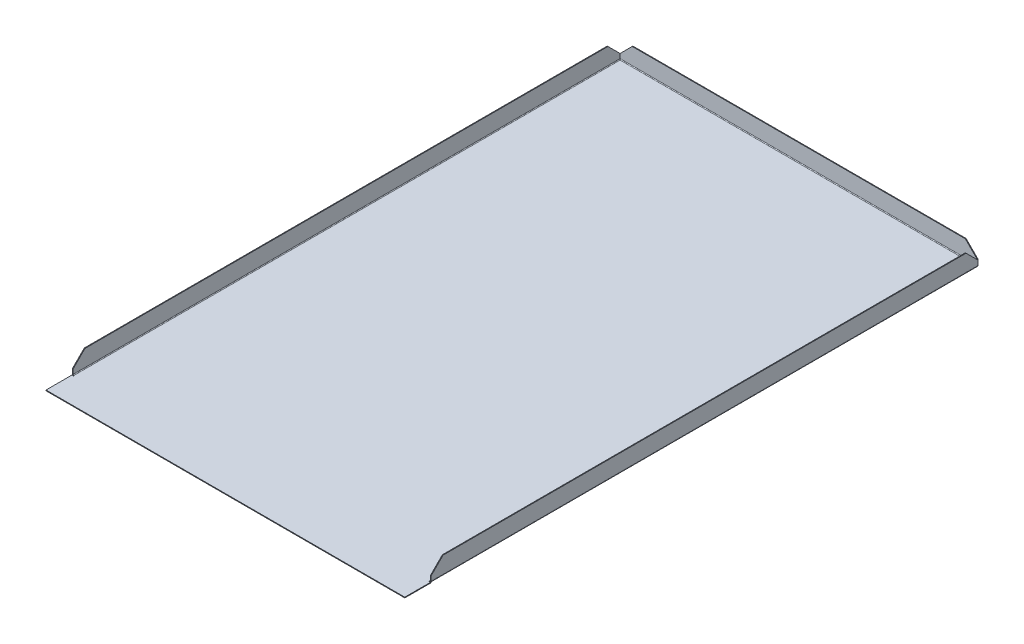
ISO-10303-21;
HEADER;
FILE_DESCRIPTION(('STEP AP214'),'2;1');
FILE_NAME('part.step','',(''),(''),'','','');
FILE_SCHEMA(('AUTOMOTIVE_DESIGN { 1 0 10303 214 1 1 1 1 }'));
ENDSEC;
DATA;
#1=APPLICATION_CONTEXT('core data for automotive mechanical design processes');
#2=APPLICATION_PROTOCOL_DEFINITION('international standard','automotive_design',2000,#1);
#3=PRODUCT_CONTEXT('',#1,'mechanical');
#4=PRODUCT('Part','Part','',(#3));
#5=PRODUCT_RELATED_PRODUCT_CATEGORY('part','',(#4));
#6=PRODUCT_DEFINITION_FORMATION('','',#4);
#7=PRODUCT_DEFINITION_CONTEXT('part definition',#1,'design');
#8=PRODUCT_DEFINITION('design','',#6,#7);
#9=PRODUCT_DEFINITION_SHAPE('','',#8);
#10=(LENGTH_UNIT() NAMED_UNIT(*) SI_UNIT(.MILLI.,.METRE.));
#11=(NAMED_UNIT(*) PLANE_ANGLE_UNIT() SI_UNIT($,.RADIAN.));
#12=(NAMED_UNIT(*) SI_UNIT($,.STERADIAN.) SOLID_ANGLE_UNIT());
#13=UNCERTAINTY_MEASURE_WITH_UNIT(LENGTH_MEASURE(1.E-05),#10,'distance_accuracy_value','');
#14=(GEOMETRIC_REPRESENTATION_CONTEXT(3) GLOBAL_UNCERTAINTY_ASSIGNED_CONTEXT((#13)) GLOBAL_UNIT_ASSIGNED_CONTEXT((#10,
#11,#12)) REPRESENTATION_CONTEXT('',''));
#15=CARTESIAN_POINT('',(0.,0.,0.));
#16=DIRECTION('',(0.,0.,1.));
#17=DIRECTION('',(1.,0.,0.));
#18=AXIS2_PLACEMENT_3D('',#15,#16,#17);
#19=CARTESIAN_POINT('',(-50.8,-3.91160000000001,407.8732));
#20=DIRECTION('',(0.,1.,0.));
#21=DIRECTION('',(0.,0.,1.));
#22=AXIS2_PLACEMENT_3D('',#19,#20,#21);
#23=CONICAL_SURFACE('',#22,6.34999999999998,0.785398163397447);
#24=CARTESIAN_POINT('',(-50.8,-0.736600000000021,407.8732));
#25=DIRECTION('',(0.,-1.,0.));
#26=DIRECTION('',(1.,0.,0.));
#27=AXIS2_PLACEMENT_3D('',#24,#25,#26);
#28=CIRCLE('',#27,9.52499999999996);
#29=CARTESIAN_POINT('',(-41.275,-0.73660000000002,407.8732));
#30=VERTEX_POINT('',#29);
#31=EDGE_CURVE('E111',#30,#30,#28,.T.);
#32=ORIENTED_EDGE('',*,*,#31,.T.);
#33=EDGE_LOOP('',(#32));
#34=FACE_BOUND('',#33,.T.);
#35=CARTESIAN_POINT('',(-50.8,-3.91160000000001,407.8732));
#36=DIRECTION('',(0.,1.,0.));
#37=DIRECTION('',(0.,0.,1.));
#38=AXIS2_PLACEMENT_3D('',#35,#36,#37);
#39=CIRCLE('',#38,6.34999999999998);
#40=CARTESIAN_POINT('',(-50.8,-3.91160000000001,414.2232));
#41=VERTEX_POINT('',#40);
#42=EDGE_CURVE('E13',#41,#41,#39,.F.);
#43=ORIENTED_EDGE('',*,*,#42,.F.);
#44=EDGE_LOOP('',(#43));
#45=FACE_BOUND('',#44,.T.);
#46=ADVANCED_FACE('F105',(#34,#45),#23,.T.);
#47=CARTESIAN_POINT('',(-50.8,-26.1366,407.8732));
#48=DIRECTION('',(0.,1.,0.));
#49=DIRECTION('',(-1.,0.,0.));
#50=AXIS2_PLACEMENT_3D('',#47,#48,#49);
#51=CYLINDRICAL_SURFACE('',#50,6.34999999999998);
#52=CARTESIAN_POINT('',(-50.8,-0.736600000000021,407.8732));
#53=DIRECTION('',(0.,-1.,0.));
#54=DIRECTION('',(1.,0.,0.));
#55=AXIS2_PLACEMENT_3D('',#52,#53,#54);
#56=CIRCLE('',#55,6.34999999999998);
#57=CARTESIAN_POINT('',(-44.45,-0.736600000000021,407.8732));
#58=VERTEX_POINT('',#57);
#59=EDGE_CURVE('E115',#58,#58,#56,.T.);
#60=ORIENTED_EDGE('',*,*,#59,.F.);
#61=EDGE_LOOP('',(#60));
#62=FACE_BOUND('',#61,.T.);
#63=ORIENTED_EDGE('',*,*,#42,.T.);
#64=EDGE_LOOP('',(#63));
#65=FACE_BOUND('',#64,.T.);
#66=ADVANCED_FACE('F125',(#62,#65),#51,.F.);
#67=CARTESIAN_POINT('',(190.5,-0.736600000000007,609.6));
#68=DIRECTION('',(0.,-1.,0.));
#69=DIRECTION('',(1.,0.,0.));
#70=AXIS2_PLACEMENT_3D('',#67,#68,#69);
#71=PLANE('',#70);
#72=ORIENTED_EDGE('',*,*,#59,.T.);
#73=EDGE_LOOP('',(#72));
#74=FACE_BOUND('',#73,.T.);
#75=ORIENTED_EDGE('',*,*,#31,.F.);
#76=EDGE_LOOP('',(#75));
#77=FACE_BOUND('',#76,.T.);
#78=ADVANCED_FACE('F122',(#74,#77),#71,.F.);
#79=CLOSED_SHELL('',(#46,#66,#78));
#80=MANIFOLD_SOLID_BREP('B2',#79);
#81=CARTESIAN_POINT('',(50.8,-3.9116,407.8732));
#82=DIRECTION('',(0.,1.,0.));
#83=DIRECTION('',(0.,0.,1.));
#84=AXIS2_PLACEMENT_3D('',#81,#82,#83);
#85=CONICAL_SURFACE('',#84,6.34999999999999,0.785398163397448);
#86=CARTESIAN_POINT('',(50.8,-0.736600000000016,407.8732));
#87=DIRECTION('',(0.,-1.,0.));
#88=DIRECTION('',(1.,0.,0.));
#89=AXIS2_PLACEMENT_3D('',#86,#87,#88);
#90=CIRCLE('',#89,9.52499999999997);
#91=CARTESIAN_POINT('',(60.325,-0.736600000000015,407.8732));
#92=VERTEX_POINT('',#91);
#93=EDGE_CURVE('E165',#92,#92,#90,.T.);
#94=ORIENTED_EDGE('',*,*,#93,.T.);
#95=EDGE_LOOP('',(#94));
#96=FACE_BOUND('',#95,.T.);
#97=CARTESIAN_POINT('',(50.8,-3.9116,407.8732));
#98=DIRECTION('',(0.,1.,0.));
#99=DIRECTION('',(0.,0.,1.));
#100=AXIS2_PLACEMENT_3D('',#97,#98,#99);
#101=CIRCLE('',#100,6.34999999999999);
#102=CARTESIAN_POINT('',(50.8,-3.9116,414.2232));
#103=VERTEX_POINT('',#102);
#104=EDGE_CURVE('E104',#103,#103,#101,.F.);
#105=ORIENTED_EDGE('',*,*,#104,.F.);
#106=EDGE_LOOP('',(#105));
#107=FACE_BOUND('',#106,.T.);
#108=ADVANCED_FACE('F159',(#96,#107),#85,.T.);
#109=CARTESIAN_POINT('',(50.8,-26.1366,407.8732));
#110=DIRECTION('',(0.,1.,0.));
#111=DIRECTION('',(-1.,0.,0.));
#112=AXIS2_PLACEMENT_3D('',#109,#110,#111);
#113=CYLINDRICAL_SURFACE('',#112,6.34999999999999);
#114=CARTESIAN_POINT('',(50.8,-0.736600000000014,407.8732));
#115=DIRECTION('',(0.,-1.,0.));
#116=DIRECTION('',(1.,0.,0.));
#117=AXIS2_PLACEMENT_3D('',#114,#115,#116);
#118=CIRCLE('',#117,6.34999999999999);
#119=CARTESIAN_POINT('',(57.15,-0.736600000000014,407.8732));
#120=VERTEX_POINT('',#119);
#121=EDGE_CURVE('E169',#120,#120,#118,.T.);
#122=ORIENTED_EDGE('',*,*,#121,.F.);
#123=EDGE_LOOP('',(#122));
#124=FACE_BOUND('',#123,.T.);
#125=ORIENTED_EDGE('',*,*,#104,.T.);
#126=EDGE_LOOP('',(#125));
#127=FACE_BOUND('',#126,.T.);
#128=ADVANCED_FACE('F179',(#124,#127),#113,.F.);
#129=CARTESIAN_POINT('',(190.5,-0.736600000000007,609.6));
#130=DIRECTION('',(0.,-1.,0.));
#131=DIRECTION('',(1.,0.,0.));
#132=AXIS2_PLACEMENT_3D('',#129,#130,#131);
#133=PLANE('',#132);
#134=ORIENTED_EDGE('',*,*,#121,.T.);
#135=EDGE_LOOP('',(#134));
#136=FACE_BOUND('',#135,.T.);
#137=ORIENTED_EDGE('',*,*,#93,.F.);
#138=EDGE_LOOP('',(#137));
#139=FACE_BOUND('',#138,.T.);
#140=ADVANCED_FACE('F176',(#136,#139),#133,.F.);
#141=CLOSED_SHELL('',(#108,#128,#140));
#142=MANIFOLD_SOLID_BREP('B8',#141);
#143=CARTESIAN_POINT('',(-50.8,-26.1366,407.8732));
#144=DIRECTION('',(0.,1.,0.));
#145=DIRECTION('',(-1.,0.,0.));
#146=AXIS2_PLACEMENT_3D('',#143,#144,#145);
#147=CYLINDRICAL_SURFACE('',#146,6.34999999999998);
#148=CARTESIAN_POINT('',(-50.8,-26.1366,407.8732));
#149=DIRECTION('',(0.,-1.,0.));
#150=DIRECTION('',(-1.,0.,0.));
#151=AXIS2_PLACEMENT_3D('',#148,#149,#150);
#152=CIRCLE('',#151,6.34999999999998);
#153=CARTESIAN_POINT('',(-57.1499999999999,-26.1366,407.8732));
#154=VERTEX_POINT('',#153);
#155=EDGE_CURVE('E158',#154,#154,#152,.T.);
#156=ORIENTED_EDGE('',*,*,#155,.F.);
#157=EDGE_LOOP('',(#156));
#158=FACE_BOUND('',#157,.T.);
#159=CARTESIAN_POINT('',(-50.8,-0.73660000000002,407.8732));
#160=DIRECTION('',(0.,-1.,0.));
#161=DIRECTION('',(-1.,0.,0.));
#162=AXIS2_PLACEMENT_3D('',#159,#160,#161);
#163=CIRCLE('',#162,6.34999999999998);
#164=CARTESIAN_POINT('',(-57.1499999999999,-0.73660000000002,407.8732));
#165=VERTEX_POINT('',#164);
#166=EDGE_CURVE('E220',#165,#165,#163,.T.);
#167=ORIENTED_EDGE('',*,*,#166,.T.);
#168=EDGE_LOOP('',(#167));
#169=FACE_BOUND('',#168,.T.);
#170=ADVANCED_FACE('F213',(#158,#169),#147,.T.);
#171=CARTESIAN_POINT('',(-50.8,-21.3741000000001,407.8732));
#172=DIRECTION('',(0.,0.,1.));
#173=DIRECTION('',(1.,0.,0.));
#174=AXIS2_PLACEMENT_3D('',#171,#172,#173);
#175=SPHERICAL_SURFACE('',#174,7.93749999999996);
#176=CARTESIAN_POINT('',(-50.8,-21.3741000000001,407.8732));
#177=DIRECTION('',(0.,-1.,0.));
#178=DIRECTION('',(-1.,0.,0.));
#179=AXIS2_PLACEMENT_3D('',#176,#177,#178);
#180=SPHERICAL_SURFACE('',#179,7.93749999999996);
#181=ORIENTED_EDGE('',*,*,#155,.T.);
#182=EDGE_LOOP('',(#181));
#183=FACE_BOUND('',#182,.T.);
#184=ADVANCED_FACE('F215',(#183),#180,.T.);
#185=CARTESIAN_POINT('',(-50.8,-0.73660000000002,407.8732));
#186=DIRECTION('',(0.,1.,0.));
#187=DIRECTION('',(-1.,0.,0.));
#188=AXIS2_PLACEMENT_3D('',#185,#186,#187);
#189=PLANE('',#188);
#190=ORIENTED_EDGE('',*,*,#166,.F.);
#191=EDGE_LOOP('',(#190));
#192=FACE_BOUND('',#191,.T.);
#193=ADVANCED_FACE('F227',(#192),#189,.T.);
#194=CLOSED_SHELL('',(#170,#184,#193));
#195=MANIFOLD_SOLID_BREP('B99',#194);
#196=CARTESIAN_POINT('',(50.8,-26.1366,407.8732));
#197=DIRECTION('',(0.,1.,0.));
#198=DIRECTION('',(-1.,0.,0.));
#199=AXIS2_PLACEMENT_3D('',#196,#197,#198);
#200=CYLINDRICAL_SURFACE('',#199,6.34999999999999);
#201=CARTESIAN_POINT('',(50.8,-26.1366,407.8732));
#202=DIRECTION('',(0.,-1.,0.));
#203=DIRECTION('',(1.,0.,0.));
#204=AXIS2_PLACEMENT_3D('',#201,#202,#203);
#205=CIRCLE('',#204,6.34999999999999);
#206=CARTESIAN_POINT('',(57.15,-26.1366,407.8732));
#207=VERTEX_POINT('',#206);
#208=EDGE_CURVE('E212',#207,#207,#205,.T.);
#209=ORIENTED_EDGE('',*,*,#208,.F.);
#210=EDGE_LOOP('',(#209));
#211=FACE_BOUND('',#210,.T.);
#212=CARTESIAN_POINT('',(50.8,-0.736600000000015,407.8732));
#213=DIRECTION('',(0.,-1.,0.));
#214=DIRECTION('',(1.,0.,0.));
#215=AXIS2_PLACEMENT_3D('',#212,#213,#214);
#216=CIRCLE('',#215,6.34999999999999);
#217=CARTESIAN_POINT('',(57.15,-0.736600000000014,407.8732));
#218=VERTEX_POINT('',#217);
#219=EDGE_CURVE('E269',#218,#218,#216,.T.);
#220=ORIENTED_EDGE('',*,*,#219,.T.);
#221=EDGE_LOOP('',(#220));
#222=FACE_BOUND('',#221,.T.);
#223=ADVANCED_FACE('F262',(#211,#222),#200,.T.);
#224=CARTESIAN_POINT('',(50.8,-21.3741,407.8732));
#225=DIRECTION('',(0.,0.,1.));
#226=DIRECTION('',(1.,0.,0.));
#227=AXIS2_PLACEMENT_3D('',#224,#225,#226);
#228=SPHERICAL_SURFACE('',#227,7.93749999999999);
#229=CARTESIAN_POINT('',(50.8,-21.3741,407.8732));
#230=DIRECTION('',(0.,-1.,0.));
#231=DIRECTION('',(1.,0.,0.));
#232=AXIS2_PLACEMENT_3D('',#229,#230,#231);
#233=SPHERICAL_SURFACE('',#232,7.93749999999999);
#234=ORIENTED_EDGE('',*,*,#208,.T.);
#235=EDGE_LOOP('',(#234));
#236=FACE_BOUND('',#235,.T.);
#237=ADVANCED_FACE('F264',(#236),#233,.T.);
#238=CARTESIAN_POINT('',(50.8,-0.736600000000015,407.8732));
#239=DIRECTION('',(0.,-1.,0.));
#240=DIRECTION('',(1.,0.,0.));
#241=AXIS2_PLACEMENT_3D('',#238,#239,#240);
#242=PLANE('',#241);
#243=ORIENTED_EDGE('',*,*,#219,.F.);
#244=EDGE_LOOP('',(#243));
#245=FACE_BOUND('',#244,.T.);
#246=ADVANCED_FACE('F276',(#245),#242,.F.);
#247=CLOSED_SHELL('',(#223,#237,#246));
#248=MANIFOLD_SOLID_BREP('B153',#247);
#249=CARTESIAN_POINT('',(190.5,0.,609.6));
#250=DIRECTION('',(0.,-1.,0.));
#251=DIRECTION('',(1.,0.,0.));
#252=AXIS2_PLACEMENT_3D('',#249,#250,#251);
#253=PLANE('',#252);
#254=DIRECTION('',(0.,0.,-1.));
#255=VECTOR('',#254,1.);
#256=CARTESIAN_POINT('',(189.0268,0.,0.916205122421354));
#257=LINE('',#256,#255);
#258=CARTESIAN_POINT('',(189.0268,0.,1.47319999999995));
#259=VERTEX_POINT('',#258);
#260=CARTESIAN_POINT('',(189.0268,0.,581.66));
#261=VERTEX_POINT('',#260);
#262=EDGE_CURVE('E549',#259,#261,#257,.F.);
#263=ORIENTED_EDGE('',*,*,#262,.F.);
#264=DIRECTION('',(-1.,0.,0.));
#265=VECTOR('',#264,1.);
#266=CARTESIAN_POINT('',(-189.583794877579,0.,1.4732));
#267=LINE('',#266,#265);
#268=CARTESIAN_POINT('',(-189.0268,0.,1.47319999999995));
#269=VERTEX_POINT('',#268);
#270=EDGE_CURVE('E655',#269,#259,#267,.F.);
#271=ORIENTED_EDGE('',*,*,#270,.F.);
#272=DIRECTION('',(0.,0.,1.));
#273=VECTOR('',#272,1.);
#274=CARTESIAN_POINT('',(-189.0268,0.,581.66));
#275=LINE('',#274,#273);
#276=CARTESIAN_POINT('',(-189.0268,0.,581.66));
#277=VERTEX_POINT('',#276);
#278=EDGE_CURVE('E898',#277,#269,#275,.F.);
#279=ORIENTED_EDGE('',*,*,#278,.F.);
#280=DIRECTION('',(-1.,0.,0.));
#281=VECTOR('',#280,1.);
#282=CARTESIAN_POINT('',(-188.6585,0.,581.66));
#283=LINE('',#282,#281);
#284=CARTESIAN_POINT('',(-188.6585,0.,581.66));
#285=VERTEX_POINT('',#284);
#286=EDGE_CURVE('E741',#285,#277,#283,.T.);
#287=ORIENTED_EDGE('',*,*,#286,.F.);
#288=DIRECTION('',(0.,0.,-1.));
#289=VECTOR('',#288,1.);
#290=CARTESIAN_POINT('',(-188.6585,0.,582.0283));
#291=LINE('',#290,#289);
#292=CARTESIAN_POINT('',(-188.6585,0.,582.0283));
#293=VERTEX_POINT('',#292);
#294=EDGE_CURVE('E737',#293,#285,#291,.T.);
#295=ORIENTED_EDGE('',*,*,#294,.F.);
#296=DIRECTION('',(1.,0.,0.));
#297=VECTOR('',#296,1.);
#298=CARTESIAN_POINT('',(-190.5,0.,582.0283));
#299=LINE('',#298,#297);
#300=CARTESIAN_POINT('',(-190.5,0.,582.0283));
#301=VERTEX_POINT('',#300);
#302=EDGE_CURVE('E732',#301,#293,#299,.T.);
#303=ORIENTED_EDGE('',*,*,#302,.F.);
#304=DIRECTION('',(0.,0.,-1.));
#305=VECTOR('',#304,1.);
#306=CARTESIAN_POINT('',(-190.5,0.,609.6));
#307=LINE('',#306,#305);
#308=CARTESIAN_POINT('',(-190.5,0.,609.6));
#309=VERTEX_POINT('',#308);
#310=EDGE_CURVE('E770',#309,#301,#307,.T.);
#311=ORIENTED_EDGE('',*,*,#310,.F.);
#312=DIRECTION('',(-1.,0.,0.));
#313=VECTOR('',#312,1.);
#314=CARTESIAN_POINT('',(190.5,0.,609.6));
#315=LINE('',#314,#313);
#316=CARTESIAN_POINT('',(190.5,0.,609.6));
#317=VERTEX_POINT('',#316);
#318=EDGE_CURVE('E750',#317,#309,#315,.T.);
#319=ORIENTED_EDGE('',*,*,#318,.F.);
#320=DIRECTION('',(0.,0.,-1.));
#321=VECTOR('',#320,1.);
#322=CARTESIAN_POINT('',(190.5,0.,609.6));
#323=LINE('',#322,#321);
#324=CARTESIAN_POINT('',(190.5,0.,582.0283));
#325=VERTEX_POINT('',#324);
#326=EDGE_CURVE('E761',#317,#325,#323,.T.);
#327=ORIENTED_EDGE('',*,*,#326,.T.);
#328=DIRECTION('',(1.,0.,0.));
#329=VECTOR('',#328,1.);
#330=CARTESIAN_POINT('',(188.6585,0.,582.0283));
#331=LINE('',#330,#329);
#332=CARTESIAN_POINT('',(188.6585,0.,582.0283));
#333=VERTEX_POINT('',#332);
#334=EDGE_CURVE('E721',#333,#325,#331,.T.);
#335=ORIENTED_EDGE('',*,*,#334,.F.);
#336=DIRECTION('',(0.,0.,1.));
#337=VECTOR('',#336,1.);
#338=CARTESIAN_POINT('',(188.6585,0.,581.66));
#339=LINE('',#338,#337);
#340=CARTESIAN_POINT('',(188.6585,0.,581.66));
#341=VERTEX_POINT('',#340);
#342=EDGE_CURVE('E717',#341,#333,#339,.T.);
#343=ORIENTED_EDGE('',*,*,#342,.F.);
#344=DIRECTION('',(-1.,0.,0.));
#345=VECTOR('',#344,1.);
#346=CARTESIAN_POINT('',(189.0268,0.,581.66));
#347=LINE('',#346,#345);
#348=EDGE_CURVE('E713',#261,#341,#347,.T.);
#349=ORIENTED_EDGE('',*,*,#348,.F.);
#350=EDGE_LOOP('',(#263,#271,#279,#287,#295,#303,#311,#319,#327,#335,#343,#349));
#351=FACE_BOUND('',#350,.T.);
#352=ADVANCED_FACE('F302',(#351),#253,.F.);
#353=CARTESIAN_POINT('',(190.5,-0.736600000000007,609.6));
#354=DIRECTION('',(0.,-1.,0.));
#355=DIRECTION('',(1.,0.,0.));
#356=AXIS2_PLACEMENT_3D('',#353,#354,#355);
#357=PLANE('',#356);
#358=DIRECTION('',(-1.,0.,0.));
#359=VECTOR('',#358,1.);
#360=CARTESIAN_POINT('',(-189.583794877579,-0.736600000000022,1.4732));
#361=LINE('',#360,#359);
#362=CARTESIAN_POINT('',(-189.0268,-0.736600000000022,1.4732));
#363=VERTEX_POINT('',#362);
#364=CARTESIAN_POINT('',(189.0268,-0.736599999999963,1.47319999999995));
#365=VERTEX_POINT('',#364);
#366=EDGE_CURVE('E664',#363,#365,#361,.F.);
#367=ORIENTED_EDGE('',*,*,#366,.T.);
#368=DIRECTION('',(0.,0.,-1.));
#369=VECTOR('',#368,1.);
#370=CARTESIAN_POINT('',(189.0268,-0.736599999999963,0.916205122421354));
#371=LINE('',#370,#369);
#372=CARTESIAN_POINT('',(189.0268,-0.736600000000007,581.66));
#373=VERTEX_POINT('',#372);
#374=EDGE_CURVE('E506',#365,#373,#371,.F.);
#375=ORIENTED_EDGE('',*,*,#374,.T.);
#376=DIRECTION('',(-1.,0.,0.));
#377=VECTOR('',#376,1.);
#378=CARTESIAN_POINT('',(190.5,-0.736600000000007,581.66));
#379=LINE('',#378,#377);
#380=CARTESIAN_POINT('',(188.6585,-0.736600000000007,581.66));
#381=VERTEX_POINT('',#380);
#382=EDGE_CURVE('E781',#373,#381,#379,.T.);
#383=ORIENTED_EDGE('',*,*,#382,.T.);
#384=DIRECTION('',(0.,0.,1.));
#385=VECTOR('',#384,1.);
#386=CARTESIAN_POINT('',(188.6585,-0.736600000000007,609.6));
#387=LINE('',#386,#385);
#388=CARTESIAN_POINT('',(188.6585,-0.736600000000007,582.0283));
#389=VERTEX_POINT('',#388);
#390=EDGE_CURVE('E778',#381,#389,#387,.T.);
#391=ORIENTED_EDGE('',*,*,#390,.T.);
#392=DIRECTION('',(1.,0.,0.));
#393=VECTOR('',#392,1.);
#394=CARTESIAN_POINT('',(190.5,-0.736600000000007,582.0283));
#395=LINE('',#394,#393);
#396=CARTESIAN_POINT('',(190.5,-0.736600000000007,582.0283));
#397=VERTEX_POINT('',#396);
#398=EDGE_CURVE('E716',#389,#397,#395,.T.);
#399=ORIENTED_EDGE('',*,*,#398,.T.);
#400=DIRECTION('',(0.,0.,-1.));
#401=VECTOR('',#400,1.);
#402=CARTESIAN_POINT('',(190.5,-0.736600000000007,609.6));
#403=LINE('',#402,#401);
#404=CARTESIAN_POINT('',(190.5,-0.736600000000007,609.6));
#405=VERTEX_POINT('',#404);
#406=EDGE_CURVE('E764',#405,#397,#403,.T.);
#407=ORIENTED_EDGE('',*,*,#406,.F.);
#408=DIRECTION('',(-1.,0.,0.));
#409=VECTOR('',#408,1.);
#410=CARTESIAN_POINT('',(190.5,-0.736600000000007,609.6));
#411=LINE('',#410,#409);
#412=CARTESIAN_POINT('',(-190.5,-0.736600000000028,609.6));
#413=VERTEX_POINT('',#412);
#414=EDGE_CURVE('E755',#405,#413,#411,.T.);
#415=ORIENTED_EDGE('',*,*,#414,.T.);
#416=DIRECTION('',(0.,0.,-1.));
#417=VECTOR('',#416,1.);
#418=CARTESIAN_POINT('',(-190.5,-0.736600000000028,609.6));
#419=LINE('',#418,#417);
#420=CARTESIAN_POINT('',(-190.5,-0.736600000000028,582.0283));
#421=VERTEX_POINT('',#420);
#422=EDGE_CURVE('E767',#413,#421,#419,.T.);
#423=ORIENTED_EDGE('',*,*,#422,.T.);
#424=DIRECTION('',(1.,0.,0.));
#425=VECTOR('',#424,1.);
#426=CARTESIAN_POINT('',(190.5,-0.736600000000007,582.0283));
#427=LINE('',#426,#425);
#428=CARTESIAN_POINT('',(-188.6585,-0.736600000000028,582.0283));
#429=VERTEX_POINT('',#428);
#430=EDGE_CURVE('E735',#421,#429,#427,.T.);
#431=ORIENTED_EDGE('',*,*,#430,.T.);
#432=DIRECTION('',(0.,0.,-1.));
#433=VECTOR('',#432,1.);
#434=CARTESIAN_POINT('',(-188.6585,-0.736600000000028,609.6));
#435=LINE('',#434,#433);
#436=CARTESIAN_POINT('',(-188.6585,-0.736600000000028,581.66));
#437=VERTEX_POINT('',#436);
#438=EDGE_CURVE('E776',#429,#437,#435,.T.);
#439=ORIENTED_EDGE('',*,*,#438,.T.);
#440=DIRECTION('',(-1.,0.,0.));
#441=VECTOR('',#440,1.);
#442=CARTESIAN_POINT('',(190.5,-0.736600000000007,581.66));
#443=LINE('',#442,#441);
#444=CARTESIAN_POINT('',(-189.0268,-0.736600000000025,581.66));
#445=VERTEX_POINT('',#444);
#446=EDGE_CURVE('E773',#437,#445,#443,.T.);
#447=ORIENTED_EDGE('',*,*,#446,.T.);
#448=DIRECTION('',(0.,0.,1.));
#449=VECTOR('',#448,1.);
#450=CARTESIAN_POINT('',(-189.0268,-0.736600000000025,581.66));
#451=LINE('',#450,#449);
#452=EDGE_CURVE('E618',#445,#363,#451,.F.);
#453=ORIENTED_EDGE('',*,*,#452,.T.);
#454=EDGE_LOOP('',(#367,#375,#383,#391,#399,#407,#415,#423,#431,#439,#447,#453));
#455=FACE_BOUND('',#454,.T.);
#456=ADVANCED_FACE('F862',(#455),#357,.T.);
#457=CARTESIAN_POINT('',(190.5,0.,609.6));
#458=DIRECTION('',(1.,0.,0.));
#459=DIRECTION('',(0.,0.,-1.));
#460=AXIS2_PLACEMENT_3D('',#457,#458,#459);
#461=PLANE('',#460);
#462=ORIENTED_EDGE('',*,*,#406,.T.);
#463=DIRECTION('',(0.,-1.,0.));
#464=VECTOR('',#463,1.);
#465=CARTESIAN_POINT('',(190.5,0.,582.0283));
#466=LINE('',#465,#464);
#467=EDGE_CURVE('E723',#325,#397,#466,.T.);
#468=ORIENTED_EDGE('',*,*,#467,.F.);
#469=ORIENTED_EDGE('',*,*,#326,.F.);
#470=DIRECTION('',(0.,-1.,0.));
#471=VECTOR('',#470,1.);
#472=CARTESIAN_POINT('',(190.5,0.,609.6));
#473=LINE('',#472,#471);
#474=EDGE_CURVE('E758',#317,#405,#473,.T.);
#475=ORIENTED_EDGE('',*,*,#474,.T.);
#476=EDGE_LOOP('',(#462,#468,#469,#475));
#477=FACE_BOUND('',#476,.T.);
#478=ADVANCED_FACE('F962',(#477),#461,.T.);
#479=CARTESIAN_POINT('',(-190.5,-0.736600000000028,609.6));
#480=DIRECTION('',(-1.,0.,0.));
#481=DIRECTION('',(0.,0.,1.));
#482=AXIS2_PLACEMENT_3D('',#479,#480,#481);
#483=PLANE('',#482);
#484=ORIENTED_EDGE('',*,*,#310,.T.);
#485=DIRECTION('',(0.,-1.,0.));
#486=VECTOR('',#485,1.);
#487=CARTESIAN_POINT('',(-190.5,0.,582.0283));
#488=LINE('',#487,#486);
#489=EDGE_CURVE('E736',#301,#421,#488,.T.);
#490=ORIENTED_EDGE('',*,*,#489,.T.);
#491=ORIENTED_EDGE('',*,*,#422,.F.);
#492=DIRECTION('',(0.,1.,0.));
#493=VECTOR('',#492,1.);
#494=CARTESIAN_POINT('',(-190.5,-0.736600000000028,609.6));
#495=LINE('',#494,#493);
#496=EDGE_CURVE('E752',#413,#309,#495,.T.);
#497=ORIENTED_EDGE('',*,*,#496,.T.);
#498=EDGE_LOOP('',(#484,#490,#491,#497));
#499=FACE_BOUND('',#498,.T.);
#500=ADVANCED_FACE('F952',(#499),#483,.T.);
#501=CARTESIAN_POINT('',(-190.5,0.,609.6));
#502=DIRECTION('',(0.,0.,-1.));
#503=DIRECTION('',(-1.,0.,0.));
#504=AXIS2_PLACEMENT_3D('',#501,#502,#503);
#505=PLANE('',#504);
#506=ORIENTED_EDGE('',*,*,#318,.T.);
#507=ORIENTED_EDGE('',*,*,#496,.F.);
#508=ORIENTED_EDGE('',*,*,#414,.F.);
#509=ORIENTED_EDGE('',*,*,#474,.F.);
#510=EDGE_LOOP('',(#506,#507,#508,#509));
#511=FACE_BOUND('',#510,.T.);
#512=ADVANCED_FACE('F958',(#511),#505,.F.);
#513=CARTESIAN_POINT('',(-190.5,0.,582.0283));
#514=DIRECTION('',(0.,0.,-1.));
#515=DIRECTION('',(0.,1.,0.));
#516=AXIS2_PLACEMENT_3D('',#513,#514,#515);
#517=PLANE('',#516);
#518=ORIENTED_EDGE('',*,*,#430,.F.);
#519=ORIENTED_EDGE('',*,*,#489,.F.);
#520=ORIENTED_EDGE('',*,*,#302,.T.);
#521=DIRECTION('',(0.,-1.,0.));
#522=VECTOR('',#521,1.);
#523=CARTESIAN_POINT('',(-188.6585,0.,582.0283));
#524=LINE('',#523,#522);
#525=EDGE_CURVE('E740',#293,#429,#524,.T.);
#526=ORIENTED_EDGE('',*,*,#525,.T.);
#527=EDGE_LOOP('',(#518,#519,#520,#526));
#528=FACE_BOUND('',#527,.T.);
#529=ADVANCED_FACE('F955',(#528),#517,.T.);
#530=CARTESIAN_POINT('',(-188.6585,0.,582.0283));
#531=DIRECTION('',(-1.,0.,0.));
#532=DIRECTION('',(0.,-1.,0.));
#533=AXIS2_PLACEMENT_3D('',#530,#531,#532);
#534=PLANE('',#533);
#535=ORIENTED_EDGE('',*,*,#438,.F.);
#536=ORIENTED_EDGE('',*,*,#525,.F.);
#537=ORIENTED_EDGE('',*,*,#294,.T.);
#538=DIRECTION('',(0.,-1.,0.));
#539=VECTOR('',#538,1.);
#540=CARTESIAN_POINT('',(-188.6585,0.,581.66));
#541=LINE('',#540,#539);
#542=EDGE_CURVE('E731',#285,#437,#541,.T.);
#543=ORIENTED_EDGE('',*,*,#542,.T.);
#544=EDGE_LOOP('',(#535,#536,#537,#543));
#545=FACE_BOUND('',#544,.T.);
#546=ADVANCED_FACE('F946',(#545),#534,.T.);
#547=CARTESIAN_POINT('',(-188.6585,0.,581.66));
#548=DIRECTION('',(0.,0.,1.));
#549=DIRECTION('',(0.,-1.,0.));
#550=AXIS2_PLACEMENT_3D('',#547,#548,#549);
#551=PLANE('',#550);
#552=ORIENTED_EDGE('',*,*,#446,.F.);
#553=ORIENTED_EDGE('',*,*,#542,.F.);
#554=ORIENTED_EDGE('',*,*,#286,.T.);
#555=DIRECTION('',(0.,-1.,0.));
#556=VECTOR('',#555,1.);
#557=CARTESIAN_POINT('',(-189.0268,0.,581.66));
#558=LINE('',#557,#556);
#559=EDGE_CURVE('E617',#277,#445,#558,.T.);
#560=ORIENTED_EDGE('',*,*,#559,.T.);
#561=EDGE_LOOP('',(#552,#553,#554,#560));
#562=FACE_BOUND('',#561,.T.);
#563=ADVANCED_FACE('F942',(#562),#551,.T.);
#564=CARTESIAN_POINT('',(189.0268,0.,581.66));
#565=DIRECTION('',(0.,0.,1.));
#566=DIRECTION('',(0.,-1.,0.));
#567=AXIS2_PLACEMENT_3D('',#564,#565,#566);
#568=PLANE('',#567);
#569=ORIENTED_EDGE('',*,*,#382,.F.);
#570=DIRECTION('',(0.,-1.,0.));
#571=VECTOR('',#570,1.);
#572=CARTESIAN_POINT('',(189.0268,0.,581.66));
#573=LINE('',#572,#571);
#574=EDGE_CURVE('E546',#261,#373,#573,.T.);
#575=ORIENTED_EDGE('',*,*,#574,.F.);
#576=ORIENTED_EDGE('',*,*,#348,.T.);
#577=DIRECTION('',(0.,-1.,0.));
#578=VECTOR('',#577,1.);
#579=CARTESIAN_POINT('',(188.6585,0.,581.66));
#580=LINE('',#579,#578);
#581=EDGE_CURVE('E720',#341,#381,#580,.T.);
#582=ORIENTED_EDGE('',*,*,#581,.T.);
#583=EDGE_LOOP('',(#569,#575,#576,#582));
#584=FACE_BOUND('',#583,.T.);
#585=ADVANCED_FACE('F851',(#584),#568,.T.);
#586=CARTESIAN_POINT('',(188.6585,0.,581.66));
#587=DIRECTION('',(1.,0.,0.));
#588=DIRECTION('',(0.,1.,0.));
#589=AXIS2_PLACEMENT_3D('',#586,#587,#588);
#590=PLANE('',#589);
#591=ORIENTED_EDGE('',*,*,#390,.F.);
#592=ORIENTED_EDGE('',*,*,#581,.F.);
#593=ORIENTED_EDGE('',*,*,#342,.T.);
#594=DIRECTION('',(0.,-1.,0.));
#595=VECTOR('',#594,1.);
#596=CARTESIAN_POINT('',(188.6585,0.,582.0283));
#597=LINE('',#596,#595);
#598=EDGE_CURVE('E709',#333,#389,#597,.T.);
#599=ORIENTED_EDGE('',*,*,#598,.T.);
#600=EDGE_LOOP('',(#591,#592,#593,#599));
#601=FACE_BOUND('',#600,.T.);
#602=ADVANCED_FACE('F859',(#601),#590,.T.);
#603=CARTESIAN_POINT('',(188.6585,0.,582.0283));
#604=DIRECTION('',(0.,0.,-1.));
#605=DIRECTION('',(0.,1.,0.));
#606=AXIS2_PLACEMENT_3D('',#603,#604,#605);
#607=PLANE('',#606);
#608=ORIENTED_EDGE('',*,*,#398,.F.);
#609=ORIENTED_EDGE('',*,*,#598,.F.);
#610=ORIENTED_EDGE('',*,*,#334,.T.);
#611=ORIENTED_EDGE('',*,*,#467,.T.);
#612=EDGE_LOOP('',(#608,#609,#610,#611));
#613=FACE_BOUND('',#612,.T.);
#614=ADVANCED_FACE('F964',(#613),#607,.T.);
#615=CARTESIAN_POINT('',(189.0268,-0.743965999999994,1.4732));
#616=CARTESIAN_POINT('',(189.073224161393,-0.743965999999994,1.27936131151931));
#617=CARTESIAN_POINT('',(189.119632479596,-0.705430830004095,1.08566498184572));
#618=CARTESIAN_POINT('',(189.212464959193,-0.557098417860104,0.727558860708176));
#619=CARTESIAN_POINT('',(189.258881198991,-0.447359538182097,0.563323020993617));
#620=CARTESIAN_POINT('',(189.351713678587,-0.173276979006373,0.289240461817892));
#621=CARTESIAN_POINT('',(189.398129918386,-0.00904113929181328,0.179501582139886));
#622=CARTESIAN_POINT('',(189.490962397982,0.349064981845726,0.0311691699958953));
#623=CARTESIAN_POINT('',(189.537370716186,0.542761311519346,-0.00736600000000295));
#624=CARTESIAN_POINT('',(189.583794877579,0.736600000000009,-0.0073660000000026));
#625=CARTESIAN_POINT('',(189.0268,-0.736599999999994,1.4732));
#626=CARTESIAN_POINT('',(189.073224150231,-0.736599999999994,1.28032570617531));
#627=CARTESIAN_POINT('',(189.119632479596,-0.698256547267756,1.08759301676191));
#628=CARTESIAN_POINT('',(189.212464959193,-0.550662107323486,0.731268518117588));
#629=CARTESIAN_POINT('',(189.258881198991,-0.441469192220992,0.567849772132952));
#630=CARTESIAN_POINT('',(189.351713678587,-0.168750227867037,0.295130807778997));
#631=CARTESIAN_POINT('',(189.398129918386,-0.00533148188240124,0.185937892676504));
#632=CARTESIAN_POINT('',(189.490962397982,0.350993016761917,0.0383434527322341));
#633=CARTESIAN_POINT('',(189.537370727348,0.543725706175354,0.));
#634=CARTESIAN_POINT('',(189.583794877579,0.736600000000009,0.));
#635=CARTESIAN_POINT('',(189.0268,0.,1.4732));
#636=CARTESIAN_POINT('',(189.073223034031,0.,1.37676517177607));
#637=CARTESIAN_POINT('',(189.119632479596,0.019171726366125,1.28039650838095));
#638=CARTESIAN_POINT('',(189.212464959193,0.09296894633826,1.10223425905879));
#639=CARTESIAN_POINT('',(189.258881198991,0.147565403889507,1.02052488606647));
#640=CARTESIAN_POINT('',(189.351713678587,0.283924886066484,0.884165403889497));
#641=CARTESIAN_POINT('',(189.398129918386,0.365634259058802,0.829568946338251));
#642=CARTESIAN_POINT('',(189.490962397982,0.543796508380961,0.755771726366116));
#643=CARTESIAN_POINT('',(189.537371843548,0.640165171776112,0.736599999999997));
#644=CARTESIAN_POINT('',(189.583794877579,0.736600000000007,0.736599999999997));
#645=CARTESIAN_POINT('',(189.0268,0.00743966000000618,1.4732));
#646=CARTESIAN_POINT('',(189.073223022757,0.00743966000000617,1.37773921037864));
#647=CARTESIAN_POINT('',(189.119632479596,0.0264177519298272,1.2823438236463));
#648=CARTESIAN_POINT('',(189.212464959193,0.0994696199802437,1.1059810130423));
#649=CARTESIAN_POINT('',(189.258881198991,0.153514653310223,1.0250969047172));
#650=CARTESIAN_POINT('',(189.351713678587,0.288496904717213,0.890114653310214));
#651=CARTESIAN_POINT('',(189.398129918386,0.369381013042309,0.836069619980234));
#652=CARTESIAN_POINT('',(189.490962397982,0.545743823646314,0.763017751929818));
#653=CARTESIAN_POINT('',(189.537371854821,0.64113921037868,0.744039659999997));
#654=CARTESIAN_POINT('',(189.583794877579,0.736600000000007,0.744039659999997));
#655=B_SPLINE_SURFACE_WITH_KNOTS('',1,3,((#615,#616,#617,#618,#619,#620,#621,#622,#623,#624),
(#625,#626,#627,#628,#629,#630,#631,#632,#633,#634),(#635,#636,#637,#638,#639,#640,#641,#642,
#643,#644),(#645,#646,#647,#648,#649,#650,#651,#652,#653,#654)),.UNSPECIFIED.,.F.,.F.,.F.,(2,1,
1,2),(4,2,2,2,4),(-0.01,0.,1.,1.0101),(0.,0.25,0.5,0.75,1.),.UNSPECIFIED.);
#656=DIRECTION('',(0.,0.,1.));
#657=VECTOR('',#656,1.);
#658=CARTESIAN_POINT('',(189.583794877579,0.736600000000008,0.736600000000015));
#659=LINE('',#658,#657);
#660=CARTESIAN_POINT('',(189.583794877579,0.736600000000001,0.));
#661=VERTEX_POINT('',#660);
#662=CARTESIAN_POINT('',(189.583794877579,0.736600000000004,0.736599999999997));
#663=VERTEX_POINT('',#662);
#664=EDGE_CURVE('E632',#661,#663,#659,.T.);
#665=CARTESIAN_POINT('',(189.0268,0.,1.4732));
#666=CARTESIAN_POINT('',(189.032602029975,-2.55665584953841E-07,1.46114739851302));
#667=CARTESIAN_POINT('',(189.038404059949,0.000295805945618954,1.44909481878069));
#668=CARTESIAN_POINT('',(189.050008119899,0.00147872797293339,1.42501868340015));
#669=CARTESIAN_POINT('',(189.055810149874,0.00236558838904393,1.41299512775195));
#670=CARTESIAN_POINT('',(189.067414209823,0.00472827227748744,1.38900602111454));
#671=CARTESIAN_POINT('',(189.073216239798,0.00620409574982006,1.37704047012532));
#672=CARTESIAN_POINT('',(189.084820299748,0.00974106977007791,1.35319619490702));
#673=CARTESIAN_POINT('',(189.090622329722,0.0118022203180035,1.34131747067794));
#674=CARTESIAN_POINT('',(189.102226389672,0.0165049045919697,1.31767546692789));
#675=CARTESIAN_POINT('',(189.108028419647,0.0191464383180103,1.30591218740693));
#676=CARTESIAN_POINT('',(189.119632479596,0.0250035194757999,1.28252941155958));
#677=CARTESIAN_POINT('',(189.125434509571,0.028219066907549,1.27090991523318));
#678=CARTESIAN_POINT('',(189.137038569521,0.0352164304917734,1.24784269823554));
#679=CARTESIAN_POINT('',(189.142840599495,0.0389982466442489,1.23639497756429));
#680=CARTESIAN_POINT('',(189.154444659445,0.047119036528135,1.2136988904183));
#681=CARTESIAN_POINT('',(189.16024668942,0.0514580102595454,1.20245052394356));
#682=CARTESIAN_POINT('',(189.171850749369,0.0606826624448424,1.18018024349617));
#683=CARTESIAN_POINT('',(189.177652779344,0.0655683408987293,1.16915832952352));
#684=CARTESIAN_POINT('',(189.189256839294,0.0758746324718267,1.14736750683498));
#685=CARTESIAN_POINT('',(189.195058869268,0.0812952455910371,1.1365985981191));
#686=CARTESIAN_POINT('',(189.206662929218,0.092658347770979,1.11533972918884));
#687=CARTESIAN_POINT('',(189.212464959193,0.0986008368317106,1.10484976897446));
#688=CARTESIAN_POINT('',(189.224069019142,0.110993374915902,1.08417406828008));
#689=CARTESIAN_POINT('',(189.229871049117,0.117443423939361,1.07398832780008));
#690=CARTESIAN_POINT('',(189.241475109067,0.130835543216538,1.05394560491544));
#691=CARTESIAN_POINT('',(189.247277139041,0.137777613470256,1.04408862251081));
#692=CARTESIAN_POINT('',(189.258881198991,0.152137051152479,1.02472716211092));
#693=CARTESIAN_POINT('',(189.264683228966,0.159554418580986,1.01522268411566));
#694=CARTESIAN_POINT('',(189.276287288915,0.174846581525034,0.996589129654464));
#695=CARTESIAN_POINT('',(189.28208931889,0.182721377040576,0.98746005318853));
#696=CARTESIAN_POINT('',(189.29369337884,0.198909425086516,0.969599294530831));
#697=CARTESIAN_POINT('',(189.299495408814,0.207222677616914,0.960867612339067));
#698=CARTESIAN_POINT('',(189.311099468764,0.224267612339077,0.943822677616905));
#699=CARTESIAN_POINT('',(189.316901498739,0.232999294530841,0.935509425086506));
#700=CARTESIAN_POINT('',(189.328505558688,0.25086005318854,0.919321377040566));
#701=CARTESIAN_POINT('',(189.334307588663,0.259989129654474,0.911446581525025));
#702=CARTESIAN_POINT('',(189.345911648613,0.278622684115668,0.896154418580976));
#703=CARTESIAN_POINT('',(189.351713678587,0.288127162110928,0.88873705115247));
#704=CARTESIAN_POINT('',(189.363317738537,0.307488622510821,0.874377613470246));
#705=CARTESIAN_POINT('',(189.369119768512,0.317345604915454,0.867435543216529));
#706=CARTESIAN_POINT('',(189.380723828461,0.337388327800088,0.854043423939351));
#707=CARTESIAN_POINT('',(189.386525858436,0.34757406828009,0.847593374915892));
#708=CARTESIAN_POINT('',(189.398129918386,0.368249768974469,0.835200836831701));
#709=CARTESIAN_POINT('',(189.40393194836,0.378739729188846,0.82925834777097));
#710=CARTESIAN_POINT('',(189.41553600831,0.399998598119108,0.817895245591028));
#711=CARTESIAN_POINT('',(189.421338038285,0.410767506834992,0.812474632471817));
#712=CARTESIAN_POINT('',(189.432942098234,0.43255832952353,0.80216834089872));
#713=CARTESIAN_POINT('',(189.438744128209,0.443580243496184,0.797282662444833));
#714=CARTESIAN_POINT('',(189.450348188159,0.465850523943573,0.788058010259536));
#715=CARTESIAN_POINT('',(189.456150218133,0.477098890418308,0.783719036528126));
#716=CARTESIAN_POINT('',(189.467754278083,0.499794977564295,0.77559824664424));
#717=CARTESIAN_POINT('',(189.473556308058,0.511242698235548,0.771816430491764));
#718=CARTESIAN_POINT('',(189.485160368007,0.534309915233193,0.76481906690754));
#719=CARTESIAN_POINT('',(189.490962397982,0.545929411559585,0.761603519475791));
#720=CARTESIAN_POINT('',(189.502566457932,0.569312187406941,0.755746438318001));
#721=CARTESIAN_POINT('',(189.508368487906,0.581075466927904,0.753104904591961));
#722=CARTESIAN_POINT('',(189.519972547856,0.604717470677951,0.748402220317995));
#723=CARTESIAN_POINT('',(189.525774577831,0.616596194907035,0.746341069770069));
#724=CARTESIAN_POINT('',(189.53737863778,0.640440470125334,0.742804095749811));
#725=CARTESIAN_POINT('',(189.543180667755,0.652406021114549,0.741328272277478));
#726=CARTESIAN_POINT('',(189.554784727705,0.676395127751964,0.738965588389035));
#727=CARTESIAN_POINT('',(189.560586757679,0.688418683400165,0.738078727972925));
#728=CARTESIAN_POINT('',(189.572190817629,0.712494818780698,0.73689580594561));
#729=CARTESIAN_POINT('',(189.577992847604,0.724547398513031,0.736599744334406));
#730=CARTESIAN_POINT('',(189.583794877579,0.736600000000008,0.736599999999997));
#731=B_SPLINE_CURVE_WITH_KNOTS('',3,(#665,#666,#667,#668,#669,#670,#671,#672,#673,#674,#675,
#676,#677,#678,#679,#680,#681,#682,#683,#684,#685,#686,#687,#688,#689,#690,#691,#692,#693,#694,
#695,#696,#697,#698,#699,#700,#701,#702,#703,#704,#705,#706,#707,#708,#709,#710,#711,#712,#713,
#714,#715,#716,#717,#718,#719,#720,#721,#722,#723,#724,#725,#726,#727,#728,#729,#730),
.UNSPECIFIED.,.F.,.F.,(4,2,2,2,2,2,2,2,2,2,2,2,2,2,2,2,2,2,2,2,2,2,2,2,2,2,2,2,2,2,2,2,4),(0.,
0.040125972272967,0.0802519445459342,0.120377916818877,0.160503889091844,0.200629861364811,
0.240755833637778,0.280881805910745,0.321007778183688,0.361133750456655,0.401259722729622,
0.441385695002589,0.481511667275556,0.521637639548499,0.56176361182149,0.601889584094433,
0.6420155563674,0.682141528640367,0.72226750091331,0.762393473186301,0.802519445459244,
0.842645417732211,0.882771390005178,0.922897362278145,0.963023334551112,1.00314930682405,
1.04327527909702,1.08340125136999,1.12352722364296,1.16365319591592,1.20377916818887,
1.24390514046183,1.2840311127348),.UNSPECIFIED.);
#732=EDGE_CURVE('E658',#259,#663,#731,.T.);
#733=DIRECTION('',(0.,-1.,0.));
#734=VECTOR('',#733,1.);
#735=CARTESIAN_POINT('',(189.0268,0.,1.4732));
#736=LINE('',#735,#734);
#737=EDGE_CURVE('E701',#259,#365,#736,.T.);
#738=CARTESIAN_POINT('',(189.0268,-0.736599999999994,1.4732));
#739=CARTESIAN_POINT('',(189.032602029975,-0.736600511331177,1.44909479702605));
#740=CARTESIAN_POINT('',(189.038404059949,-0.736008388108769,1.42498963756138));
#741=CARTESIAN_POINT('',(189.050008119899,-0.733642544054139,1.37683736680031));
#742=CARTESIAN_POINT('',(189.055810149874,-0.731868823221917,1.3527902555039));
#743=CARTESIAN_POINT('',(189.067414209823,-0.727143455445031,1.30481204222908));
#744=CARTESIAN_POINT('',(189.073216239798,-0.724191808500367,1.28088094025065));
#745=CARTESIAN_POINT('',(189.084820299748,-0.717117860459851,1.23319238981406));
#746=CARTESIAN_POINT('',(189.090622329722,-0.712995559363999,1.20943494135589));
#747=CARTESIAN_POINT('',(189.102226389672,-0.703590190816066,1.16215093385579));
#748=CARTESIAN_POINT('',(189.108028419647,-0.698307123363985,1.13862437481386));
#749=CARTESIAN_POINT('',(189.119632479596,-0.686592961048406,1.09185882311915));
#750=CARTESIAN_POINT('',(189.125434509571,-0.680161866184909,1.06861983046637));
#751=CARTESIAN_POINT('',(189.137038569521,-0.666167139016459,1.02248539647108));
#752=CARTESIAN_POINT('',(189.142840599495,-0.658603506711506,0.999589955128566));
#753=CARTESIAN_POINT('',(189.154444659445,-0.642361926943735,0.954197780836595));
#754=CARTESIAN_POINT('',(189.16024668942,-0.633683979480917,0.931701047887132));
#755=CARTESIAN_POINT('',(189.171850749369,-0.615234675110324,0.887160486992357));
#756=CARTESIAN_POINT('',(189.177652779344,-0.605463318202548,0.865116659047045));
#757=CARTESIAN_POINT('',(189.189256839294,-0.584850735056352,0.821535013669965));
#758=CARTESIAN_POINT('',(189.195058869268,-0.574009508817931,0.799997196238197));
#759=CARTESIAN_POINT('',(189.206662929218,-0.551283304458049,0.757479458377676));
#760=CARTESIAN_POINT('',(189.212464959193,-0.539398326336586,0.736499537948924));
#761=CARTESIAN_POINT('',(189.224069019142,-0.514613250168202,0.695148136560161));
#762=CARTESIAN_POINT('',(189.229871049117,-0.501713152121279,0.674776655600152));
#763=CARTESIAN_POINT('',(189.241475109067,-0.474928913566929,0.634691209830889));
#764=CARTESIAN_POINT('',(189.247277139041,-0.461044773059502,0.614977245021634));
#765=CARTESIAN_POINT('',(189.258881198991,-0.432325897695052,0.576254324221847));
#766=CARTESIAN_POINT('',(189.264683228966,-0.417491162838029,0.557245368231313));
#767=CARTESIAN_POINT('',(189.276287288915,-0.38690683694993,0.519978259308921));
#768=CARTESIAN_POINT('',(189.28208931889,-0.371157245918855,0.501720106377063));
#769=CARTESIAN_POINT('',(189.29369337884,-0.33878114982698,0.465998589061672));
#770=CARTESIAN_POINT('',(189.299495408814,-0.32215464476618,0.44853522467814));
#771=CARTESIAN_POINT('',(189.311099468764,-0.288064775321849,0.414445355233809));
#772=CARTESIAN_POINT('',(189.316901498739,-0.270601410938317,0.39781885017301));
#773=CARTESIAN_POINT('',(189.328505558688,-0.234879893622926,0.365442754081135));
#774=CARTESIAN_POINT('',(189.334307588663,-0.216621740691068,0.349693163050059));
#775=CARTESIAN_POINT('',(189.345911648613,-0.179354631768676,0.31910883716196));
#776=CARTESIAN_POINT('',(189.351713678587,-0.160345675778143,0.304274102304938));
#777=CARTESIAN_POINT('',(189.363317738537,-0.121622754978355,0.275555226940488));
#778=CARTESIAN_POINT('',(189.369119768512,-0.1019087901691,0.261671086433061));
#779=CARTESIAN_POINT('',(189.380723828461,-0.0618233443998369,0.234886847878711));
#780=CARTESIAN_POINT('',(189.386525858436,-0.0414518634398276,0.221986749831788));
#781=CARTESIAN_POINT('',(189.398129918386,-0.000100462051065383,0.197201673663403));
#782=CARTESIAN_POINT('',(189.40393194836,0.0208794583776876,0.185316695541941));
#783=CARTESIAN_POINT('',(189.41553600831,0.0633971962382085,0.162590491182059));
#784=CARTESIAN_POINT('',(189.421338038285,0.0849350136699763,0.151749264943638));
#785=CARTESIAN_POINT('',(189.432942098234,0.128516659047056,0.131136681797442));
#786=CARTESIAN_POINT('',(189.438744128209,0.150560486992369,0.121365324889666));
#787=CARTESIAN_POINT('',(189.450348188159,0.195101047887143,0.102916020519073));
#788=CARTESIAN_POINT('',(189.456150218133,0.217597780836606,0.0942380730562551));
#789=CARTESIAN_POINT('',(189.467754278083,0.262989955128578,0.0779964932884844));
#790=CARTESIAN_POINT('',(189.473556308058,0.285885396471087,0.0704328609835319));
#791=CARTESIAN_POINT('',(189.485160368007,0.332019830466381,0.0564381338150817));
#792=CARTESIAN_POINT('',(189.490962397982,0.355258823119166,0.050007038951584));
#793=CARTESIAN_POINT('',(189.502566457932,0.402024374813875,0.0382928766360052));
#794=CARTESIAN_POINT('',(189.508368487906,0.4255509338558,0.0330098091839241));
#795=CARTESIAN_POINT('',(189.519972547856,0.472834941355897,0.0236044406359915));
#796=CARTESIAN_POINT('',(189.525774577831,0.49659238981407,0.0194821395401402));
#797=CARTESIAN_POINT('',(189.53737863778,0.544280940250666,0.0124081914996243));
#798=CARTESIAN_POINT('',(189.543180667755,0.568212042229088,0.00945654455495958));
#799=CARTESIAN_POINT('',(189.554784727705,0.616190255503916,0.00473117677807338));
#800=CARTESIAN_POINT('',(189.560586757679,0.64023736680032,0.0029574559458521));
#801=CARTESIAN_POINT('',(189.572190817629,0.688389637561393,0.000591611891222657));
#802=CARTESIAN_POINT('',(189.577992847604,0.712494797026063,-5.11331185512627E-07));
#803=CARTESIAN_POINT('',(189.583794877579,0.736600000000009,0.));
#804=B_SPLINE_CURVE_WITH_KNOTS('',3,(#738,#739,#740,#741,#742,#743,#744,#745,#746,#747,#748,
#749,#750,#751,#752,#753,#754,#755,#756,#757,#758,#759,#760,#761,#762,#763,#764,#765,#766,#767,
#768,#769,#770,#771,#772,#773,#774,#775,#776,#777,#778,#779,#780,#781,#782,#783,#784,#785,#786,
#787,#788,#789,#790,#791,#792,#793,#794,#795,#796,#797,#798,#799,#800,#801,#802,#803),
.UNSPECIFIED.,.F.,.F.,(4,2,2,2,2,2,2,2,2,2,2,2,2,2,2,2,2,2,2,2,2,2,2,2,2,2,2,2,2,2,2,2,4),(0.,
0.0743737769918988,0.148747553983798,0.223121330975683,0.297495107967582,0.371868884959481,
0.44624266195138,0.520616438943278,0.594990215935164,0.669363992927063,0.743737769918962,
0.81811154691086,0.892485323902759,0.966859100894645,1.04123287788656,1.11560665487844,
1.18998043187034,1.26435420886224,1.33872798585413,1.41310176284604,1.48747553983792,
1.56184931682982,1.63622309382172,1.71059687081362,1.78497064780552,1.8593444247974,
1.9337182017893,2.0080919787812,2.0824657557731,2.156839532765,2.23121330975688,
2.30558708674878,2.37996086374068),.UNSPECIFIED.);
#805=EDGE_CURVE('E691',#365,#661,#804,.T.);
#806=ORIENTED_EDGE('',*,*,#664,.T.);
#807=ORIENTED_EDGE('',*,*,#732,.F.);
#808=ORIENTED_EDGE('',*,*,#737,.T.);
#809=ORIENTED_EDGE('',*,*,#805,.T.);
#810=EDGE_LOOP('',(#806,#807,#808,#809));
#811=FACE_BOUND('',#810,.T.);
#812=ADVANCED_FACE('F682',(#811),#655,.F.);
#813=CARTESIAN_POINT('',(-189.583794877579,0.736599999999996,-0.0073660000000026));
#814=CARTESIAN_POINT('',(-189.537370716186,0.542761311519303,-0.00736600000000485));
#815=CARTESIAN_POINT('',(-189.490962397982,0.34906498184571,0.0311691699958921));
#816=CARTESIAN_POINT('',(-189.398129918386,-0.00904113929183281,0.179501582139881));
#817=CARTESIAN_POINT('',(-189.351713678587,-0.173276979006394,0.289240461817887));
#818=CARTESIAN_POINT('',(-189.258881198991,-0.447359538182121,0.563323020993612));
#819=CARTESIAN_POINT('',(-189.212464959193,-0.557098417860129,0.727558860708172));
#820=CARTESIAN_POINT('',(-189.119632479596,-0.705430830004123,1.08566498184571));
#821=CARTESIAN_POINT('',(-189.073224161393,-0.743966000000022,1.27936131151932));
#822=CARTESIAN_POINT('',(-189.0268,-0.743966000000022,1.4732));
#823=CARTESIAN_POINT('',(-189.583794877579,0.736599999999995,0.));
#824=CARTESIAN_POINT('',(-189.537370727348,0.54372570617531,0.));
#825=CARTESIAN_POINT('',(-189.490962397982,0.350993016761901,0.0383434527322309));
#826=CARTESIAN_POINT('',(-189.398129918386,-0.00533148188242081,0.185937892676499));
#827=CARTESIAN_POINT('',(-189.351713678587,-0.168750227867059,0.295130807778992));
#828=CARTESIAN_POINT('',(-189.258881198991,-0.441469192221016,0.567849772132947));
#829=CARTESIAN_POINT('',(-189.212464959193,-0.550662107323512,0.731268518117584));
#830=CARTESIAN_POINT('',(-189.119632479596,-0.698256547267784,1.0875930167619));
#831=CARTESIAN_POINT('',(-189.073224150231,-0.736600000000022,1.28032570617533));
#832=CARTESIAN_POINT('',(-189.0268,-0.736600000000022,1.4732));
#833=CARTESIAN_POINT('',(-189.583794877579,0.736599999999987,0.736599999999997));
#834=CARTESIAN_POINT('',(-189.537371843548,0.640165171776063,0.736599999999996));
#835=CARTESIAN_POINT('',(-189.490962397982,0.54379650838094,0.755771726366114));
#836=CARTESIAN_POINT('',(-189.398129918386,0.365634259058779,0.829568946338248));
#837=CARTESIAN_POINT('',(-189.351713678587,0.28392488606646,0.884165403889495));
#838=CARTESIAN_POINT('',(-189.258881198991,0.147565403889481,1.02052488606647));
#839=CARTESIAN_POINT('',(-189.212464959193,0.0929689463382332,1.10223425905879));
#840=CARTESIAN_POINT('',(-189.119632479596,0.0191717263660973,1.28039650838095));
#841=CARTESIAN_POINT('',(-189.073223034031,0.,1.3767651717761));
#842=CARTESIAN_POINT('',(-189.0268,0.,1.4732));
#843=CARTESIAN_POINT('',(-189.583794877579,0.736599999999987,0.744039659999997));
#844=CARTESIAN_POINT('',(-189.537371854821,0.641139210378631,0.744039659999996));
#845=CARTESIAN_POINT('',(-189.490962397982,0.545743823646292,0.763017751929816));
#846=CARTESIAN_POINT('',(-189.398129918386,0.369381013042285,0.836069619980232));
#847=CARTESIAN_POINT('',(-189.351713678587,0.288496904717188,0.890114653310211));
#848=CARTESIAN_POINT('',(-189.258881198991,0.153514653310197,1.0250969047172));
#849=CARTESIAN_POINT('',(-189.212464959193,0.0994696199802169,1.1059810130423));
#850=CARTESIAN_POINT('',(-189.119632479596,0.0264177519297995,1.2823438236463));
#851=CARTESIAN_POINT('',(-189.073223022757,0.0074396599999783,1.37773921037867));
#852=CARTESIAN_POINT('',(-189.0268,0.00743965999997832,1.4732));
#853=B_SPLINE_SURFACE_WITH_KNOTS('',1,3,((#813,#814,#815,#816,#817,#818,#819,#820,#821,#822),
(#823,#824,#825,#826,#827,#828,#829,#830,#831,#832),(#833,#834,#835,#836,#837,#838,#839,#840,
#841,#842),(#843,#844,#845,#846,#847,#848,#849,#850,#851,#852)),.UNSPECIFIED.,.F.,.F.,.F.,(2,1,
1,2),(4,2,2,2,4),(-0.01,0.,1.,1.0101),(0.,0.25,0.5,0.75,1.),.UNSPECIFIED.);
#854=CARTESIAN_POINT('',(-189.583794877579,0.736599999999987,0.736599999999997));
#855=CARTESIAN_POINT('',(-189.577992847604,0.724547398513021,0.736599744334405));
#856=CARTESIAN_POINT('',(-189.572190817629,0.712494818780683,0.736895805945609));
#857=CARTESIAN_POINT('',(-189.560586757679,0.688418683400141,0.738078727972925));
#858=CARTESIAN_POINT('',(-189.554784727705,0.676395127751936,0.738965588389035));
#859=CARTESIAN_POINT('',(-189.543180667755,0.652406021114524,0.741328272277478));
#860=CARTESIAN_POINT('',(-189.53737863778,0.640440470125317,0.742804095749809));
#861=CARTESIAN_POINT('',(-189.525774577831,0.61659619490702,0.746341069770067));
#862=CARTESIAN_POINT('',(-189.519972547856,0.604717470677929,0.748402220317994));
#863=CARTESIAN_POINT('',(-189.508368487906,0.581075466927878,0.75310490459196));
#864=CARTESIAN_POINT('',(-189.502566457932,0.569312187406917,0.755746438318));
#865=CARTESIAN_POINT('',(-189.490962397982,0.545929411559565,0.761603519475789));
#866=CARTESIAN_POINT('',(-189.485160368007,0.534309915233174,0.764819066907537));
#867=CARTESIAN_POINT('',(-189.473556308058,0.511242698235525,0.771816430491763));
#868=CARTESIAN_POINT('',(-189.467754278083,0.499794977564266,0.77559824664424));
#869=CARTESIAN_POINT('',(-189.456150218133,0.477098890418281,0.783719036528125));
#870=CARTESIAN_POINT('',(-189.450348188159,0.465850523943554,0.788058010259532));
#871=CARTESIAN_POINT('',(-189.438744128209,0.443580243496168,0.797282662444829));
#872=CARTESIAN_POINT('',(-189.432942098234,0.432558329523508,0.802168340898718));
#873=CARTESIAN_POINT('',(-189.421338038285,0.410767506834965,0.812474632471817));
#874=CARTESIAN_POINT('',(-189.41553600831,0.399998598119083,0.817895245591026));
#875=CARTESIAN_POINT('',(-189.40393194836,0.378739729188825,0.829258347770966));
#876=CARTESIAN_POINT('',(-189.398129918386,0.368249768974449,0.835200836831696));
#877=CARTESIAN_POINT('',(-189.386525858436,0.347574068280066,0.84759337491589));
#878=CARTESIAN_POINT('',(-189.380723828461,0.337388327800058,0.854043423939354));
#879=CARTESIAN_POINT('',(-189.369119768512,0.317345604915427,0.867435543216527));
#880=CARTESIAN_POINT('',(-189.363317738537,0.307488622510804,0.874377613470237));
#881=CARTESIAN_POINT('',(-189.351713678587,0.28812716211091,0.888737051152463));
#882=CARTESIAN_POINT('',(-189.345911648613,0.278622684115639,0.896154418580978));
#883=CARTESIAN_POINT('',(-189.334307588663,0.25998912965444,0.911446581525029));
#884=CARTESIAN_POINT('',(-189.328505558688,0.250860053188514,0.919321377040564));
#885=CARTESIAN_POINT('',(-189.316901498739,0.232999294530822,0.935509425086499));
#886=CARTESIAN_POINT('',(-189.311099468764,0.224267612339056,0.943822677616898));
#887=CARTESIAN_POINT('',(-189.299495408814,0.207222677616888,0.960867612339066));
#888=CARTESIAN_POINT('',(-189.29369337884,0.198909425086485,0.969599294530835));
#889=CARTESIAN_POINT('',(-189.28208931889,0.182721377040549,0.987460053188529));
#890=CARTESIAN_POINT('',(-189.276287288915,0.174846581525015,0.996589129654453));
#891=CARTESIAN_POINT('',(-189.264683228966,0.159554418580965,1.01522268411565));
#892=CARTESIAN_POINT('',(-189.258881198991,0.152137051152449,1.02472716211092));
#893=CARTESIAN_POINT('',(-189.247277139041,0.137777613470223,1.04408862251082));
#894=CARTESIAN_POINT('',(-189.241475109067,0.130835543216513,1.05394560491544));
#895=CARTESIAN_POINT('',(-189.229871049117,0.117443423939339,1.07398832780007));
#896=CARTESIAN_POINT('',(-189.224069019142,0.110993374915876,1.08417406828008));
#897=CARTESIAN_POINT('',(-189.212464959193,0.0986008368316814,1.10484976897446));
#898=CARTESIAN_POINT('',(-189.206662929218,0.0926583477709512,1.11533972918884));
#899=CARTESIAN_POINT('',(-189.195058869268,0.0812952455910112,1.13659859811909));
#900=CARTESIAN_POINT('',(-189.189256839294,0.0758746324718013,1.14736750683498));
#901=CARTESIAN_POINT('',(-189.177652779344,0.0655683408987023,1.16915832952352));
#902=CARTESIAN_POINT('',(-189.171850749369,0.060682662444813,1.18018024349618));
#903=CARTESIAN_POINT('',(-189.16024668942,0.0514580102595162,1.20245052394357));
#904=CARTESIAN_POINT('',(-189.154444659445,0.0471190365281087,1.21369889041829));
#905=CARTESIAN_POINT('',(-189.142840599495,0.0389982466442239,1.23639497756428));
#906=CARTESIAN_POINT('',(-189.137038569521,0.0352164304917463,1.24784269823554));
#907=CARTESIAN_POINT('',(-189.125434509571,0.0282190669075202,1.27090991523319));
#908=CARTESIAN_POINT('',(-189.119632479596,0.0250035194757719,1.28252941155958));
#909=CARTESIAN_POINT('',(-189.108028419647,0.0191464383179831,1.30591218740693));
#910=CARTESIAN_POINT('',(-189.102226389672,0.0165049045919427,1.31767546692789));
#911=CARTESIAN_POINT('',(-189.090622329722,0.011802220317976,1.34131747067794));
#912=CARTESIAN_POINT('',(-189.084820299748,0.00974106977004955,1.35319619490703));
#913=CARTESIAN_POINT('',(-189.073216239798,0.00620409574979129,1.37704047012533));
#914=CARTESIAN_POINT('',(-189.067414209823,0.00472827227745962,1.38900602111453));
#915=CARTESIAN_POINT('',(-189.055810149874,0.00236558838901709,1.41299512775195));
#916=CARTESIAN_POINT('',(-189.050008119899,0.00147872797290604,1.42501868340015));
#917=CARTESIAN_POINT('',(-189.038404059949,0.000295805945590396,1.44909481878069));
#918=CARTESIAN_POINT('',(-189.032602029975,-2.55665614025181E-07,1.46114739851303));
#919=CARTESIAN_POINT('',(-189.0268,0.,1.4732));
#920=B_SPLINE_CURVE_WITH_KNOTS('',3,(#854,#855,#856,#857,#858,#859,#860,#861,#862,#863,#864,
#865,#866,#867,#868,#869,#870,#871,#872,#873,#874,#875,#876,#877,#878,#879,#880,#881,#882,#883,
#884,#885,#886,#887,#888,#889,#890,#891,#892,#893,#894,#895,#896,#897,#898,#899,#900,#901,#902,
#903,#904,#905,#906,#907,#908,#909,#910,#911,#912,#913,#914,#915,#916,#917,#918,#919),
.UNSPECIFIED.,.F.,.F.,(4,2,2,2,2,2,2,2,2,2,2,2,2,2,2,2,2,2,2,2,2,2,2,2,2,2,2,2,2,2,2,2,4),(0.,
0.0401259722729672,0.0802519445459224,0.12037791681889,0.160503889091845,0.200629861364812,
0.240755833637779,0.280881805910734,0.321007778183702,0.361133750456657,0.401259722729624,
0.441385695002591,0.481511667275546,0.521637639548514,0.561763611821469,0.601889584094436,
0.642015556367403,0.682141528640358,0.722267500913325,0.762393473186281,0.802519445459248,
0.842645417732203,0.88277139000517,0.922897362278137,0.963023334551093,1.00314930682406,
1.04327527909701,1.08340125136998,1.12352722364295,1.1636531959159,1.20377916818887,
1.24390514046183,1.28403111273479),.UNSPECIFIED.);
#921=CARTESIAN_POINT('',(-189.583794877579,0.736599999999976,0.736599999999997));
#922=VERTEX_POINT('',#921);
#923=EDGE_CURVE('E631',#922,#269,#920,.T.);
#924=DIRECTION('',(0.,0.,-1.));
#925=VECTOR('',#924,1.);
#926=CARTESIAN_POINT('',(-189.583794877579,0.736599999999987,0.736600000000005));
#927=LINE('',#926,#925);
#928=CARTESIAN_POINT('',(-189.583794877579,0.736599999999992,0.));
#929=VERTEX_POINT('',#928);
#930=EDGE_CURVE('E628',#929,#922,#927,.F.);
#931=CARTESIAN_POINT('',(-189.583794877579,0.736599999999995,0.));
#932=CARTESIAN_POINT('',(-189.577992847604,0.712494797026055,-5.11331186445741E-07));
#933=CARTESIAN_POINT('',(-189.572190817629,0.688389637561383,0.000591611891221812));
#934=CARTESIAN_POINT('',(-189.560586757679,0.640237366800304,0.00295745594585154));
#935=CARTESIAN_POINT('',(-189.554784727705,0.616190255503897,0.00473117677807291));
#936=CARTESIAN_POINT('',(-189.543180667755,0.568212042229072,0.00945654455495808));
#937=CARTESIAN_POINT('',(-189.53737863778,0.544280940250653,0.012408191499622));
#938=CARTESIAN_POINT('',(-189.525774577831,0.496592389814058,0.0194821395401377));
#939=CARTESIAN_POINT('',(-189.519972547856,0.472834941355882,0.0236044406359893));
#940=CARTESIAN_POINT('',(-189.508368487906,0.425550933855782,0.0330098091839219));
#941=CARTESIAN_POINT('',(-189.502566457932,0.402024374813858,0.0382928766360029));
#942=CARTESIAN_POINT('',(-189.490962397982,0.35525882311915,0.0500070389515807));
#943=CARTESIAN_POINT('',(-189.485160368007,0.332019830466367,0.0564381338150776));
#944=CARTESIAN_POINT('',(-189.473556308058,0.28588539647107,0.0704328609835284));
#945=CARTESIAN_POINT('',(-189.467754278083,0.262989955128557,0.0779964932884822));
#946=CARTESIAN_POINT('',(-189.456150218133,0.217597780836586,0.094238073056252));
#947=CARTESIAN_POINT('',(-189.450348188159,0.195101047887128,0.102916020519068));
#948=CARTESIAN_POINT('',(-189.438744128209,0.150560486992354,0.121365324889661));
#949=CARTESIAN_POINT('',(-189.432942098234,0.128516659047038,0.131136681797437));
#950=CARTESIAN_POINT('',(-189.421338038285,0.0849350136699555,0.151749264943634));
#951=CARTESIAN_POINT('',(-189.41553600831,0.0633971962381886,0.162590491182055));
#952=CARTESIAN_POINT('',(-189.40393194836,0.0208794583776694,0.185316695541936));
#953=CARTESIAN_POINT('',(-189.398129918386,-0.000100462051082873,0.197201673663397));
#954=CARTESIAN_POINT('',(-189.386525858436,-0.041451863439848,0.221986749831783));
#955=CARTESIAN_POINT('',(-189.380723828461,-0.0618233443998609,0.234886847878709));
#956=CARTESIAN_POINT('',(-189.369119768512,-0.101908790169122,0.261671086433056));
#957=CARTESIAN_POINT('',(-189.363317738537,-0.121622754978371,0.275555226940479));
#958=CARTESIAN_POINT('',(-189.351713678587,-0.16034567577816,0.30427410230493));
#959=CARTESIAN_POINT('',(-189.345911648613,-0.1793546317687,0.319108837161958));
#960=CARTESIAN_POINT('',(-189.334307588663,-0.216621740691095,0.349693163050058));
#961=CARTESIAN_POINT('',(-189.328505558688,-0.234879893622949,0.36544275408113));
#962=CARTESIAN_POINT('',(-189.316901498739,-0.270601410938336,0.397818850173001));
#963=CARTESIAN_POINT('',(-189.311099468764,-0.288064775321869,0.414445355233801));
#964=CARTESIAN_POINT('',(-189.299495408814,-0.322154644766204,0.448535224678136));
#965=CARTESIAN_POINT('',(-189.29369337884,-0.338781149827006,0.465998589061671));
#966=CARTESIAN_POINT('',(-189.28208931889,-0.371157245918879,0.501720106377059));
#967=CARTESIAN_POINT('',(-189.276287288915,-0.386906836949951,0.519978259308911));
#968=CARTESIAN_POINT('',(-189.264683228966,-0.41749116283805,0.557245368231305));
#969=CARTESIAN_POINT('',(-189.258881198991,-0.432325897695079,0.576254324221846));
#970=CARTESIAN_POINT('',(-189.247277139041,-0.46104477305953,0.614977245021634));
#971=CARTESIAN_POINT('',(-189.241475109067,-0.474928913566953,0.634691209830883));
#972=CARTESIAN_POINT('',(-189.229871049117,-0.501713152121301,0.674776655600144));
#973=CARTESIAN_POINT('',(-189.224069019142,-0.514613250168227,0.695148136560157));
#974=CARTESIAN_POINT('',(-189.212464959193,-0.539398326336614,0.736499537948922));
#975=CARTESIAN_POINT('',(-189.206662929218,-0.551283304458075,0.757479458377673));
#976=CARTESIAN_POINT('',(-189.195058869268,-0.574009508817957,0.799997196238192));
#977=CARTESIAN_POINT('',(-189.189256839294,-0.584850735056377,0.821535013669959));
#978=CARTESIAN_POINT('',(-189.177652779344,-0.605463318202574,0.865116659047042));
#979=CARTESIAN_POINT('',(-189.171850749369,-0.615234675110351,0.887160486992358));
#980=CARTESIAN_POINT('',(-189.16024668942,-0.633683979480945,0.931701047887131));
#981=CARTESIAN_POINT('',(-189.154444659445,-0.642361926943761,0.954197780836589));
#982=CARTESIAN_POINT('',(-189.142840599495,-0.658603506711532,0.99958995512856));
#983=CARTESIAN_POINT('',(-189.137038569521,-0.666167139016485,1.02248539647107));
#984=CARTESIAN_POINT('',(-189.125434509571,-0.680161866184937,1.06861983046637));
#985=CARTESIAN_POINT('',(-189.119632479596,-0.686592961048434,1.09185882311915));
#986=CARTESIAN_POINT('',(-189.108028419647,-0.698307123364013,1.13862437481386));
#987=CARTESIAN_POINT('',(-189.102226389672,-0.703590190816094,1.16215093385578));
#988=CARTESIAN_POINT('',(-189.090622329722,-0.712995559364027,1.20943494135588));
#989=CARTESIAN_POINT('',(-189.084820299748,-0.717117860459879,1.23319238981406));
#990=CARTESIAN_POINT('',(-189.073216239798,-0.724191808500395,1.28088094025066));
#991=CARTESIAN_POINT('',(-189.067414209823,-0.727143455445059,1.30481204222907));
#992=CARTESIAN_POINT('',(-189.055810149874,-0.731868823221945,1.3527902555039));
#993=CARTESIAN_POINT('',(-189.050008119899,-0.733642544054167,1.37683736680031));
#994=CARTESIAN_POINT('',(-189.038404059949,-0.736008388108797,1.42498963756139));
#995=CARTESIAN_POINT('',(-189.032602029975,-0.736600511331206,1.44909479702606));
#996=CARTESIAN_POINT('',(-189.0268,-0.736600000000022,1.4732));
#997=B_SPLINE_CURVE_WITH_KNOTS('',3,(#931,#932,#933,#934,#935,#936,#937,#938,#939,#940,#941,
#942,#943,#944,#945,#946,#947,#948,#949,#950,#951,#952,#953,#954,#955,#956,#957,#958,#959,#960,
#961,#962,#963,#964,#965,#966,#967,#968,#969,#970,#971,#972,#973,#974,#975,#976,#977,#978,#979,
#980,#981,#982,#983,#984,#985,#986,#987,#988,#989,#990,#991,#992,#993,#994,#995,#996),
.UNSPECIFIED.,.F.,.F.,(4,2,2,2,2,2,2,2,2,2,2,2,2,2,2,2,2,2,2,2,2,2,2,2,2,2,2,2,2,2,2,2,4),(0.,
0.0743737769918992,0.148747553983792,0.223121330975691,0.297495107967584,0.371868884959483,
0.446242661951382,0.520616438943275,0.594990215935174,0.669363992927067,0.743737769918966,
0.818111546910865,0.892485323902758,0.966859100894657,1.04123287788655,1.11560665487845,
1.18998043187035,1.26435420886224,1.33872798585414,1.41310176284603,1.48747553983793,
1.56184931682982,1.63622309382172,1.71059687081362,1.78497064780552,1.85934442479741,
1.93371820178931,2.00809197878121,2.08246575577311,2.156839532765,2.2312133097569,
2.30558708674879,2.37996086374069),.UNSPECIFIED.);
#998=EDGE_CURVE('E663',#929,#363,#997,.T.);
#999=DIRECTION('',(0.,-1.,0.));
#1000=VECTOR('',#999,1.);
#1001=CARTESIAN_POINT('',(-189.0268,0.,1.4732));
#1002=LINE('',#1001,#1000);
#1003=EDGE_CURVE('E710',#269,#363,#1002,.T.);
#1004=ORIENTED_EDGE('',*,*,#923,.F.);
#1005=ORIENTED_EDGE('',*,*,#930,.F.);
#1006=ORIENTED_EDGE('',*,*,#998,.T.);
#1007=ORIENTED_EDGE('',*,*,#1003,.F.);
#1008=EDGE_LOOP('',(#1004,#1005,#1006,#1007));
#1009=FACE_BOUND('',#1008,.T.);
#1010=ADVANCED_FACE('F679',(#1009),#853,.F.);
#1011=CARTESIAN_POINT('',(-189.583794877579,0.736599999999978,1.4732));
#1012=DIRECTION('',(-1.,0.,0.));
#1013=DIRECTION('',(0.,0.,-1.));
#1014=AXIS2_PLACEMENT_3D('',#1011,#1012,#1013);
#1015=CYLINDRICAL_SURFACE('',#1014,1.4732);
#1016=ORIENTED_EDGE('',*,*,#366,.F.);
#1017=ORIENTED_EDGE('',*,*,#998,.F.);
#1018=DIRECTION('',(-1.,0.,0.));
#1019=VECTOR('',#1018,1.);
#1020=CARTESIAN_POINT('',(190.5,0.736600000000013,0.));
#1021=LINE('',#1020,#1019);
#1022=EDGE_CURVE('E640',#929,#661,#1021,.F.);
#1023=ORIENTED_EDGE('',*,*,#1022,.T.);
#1024=ORIENTED_EDGE('',*,*,#805,.F.);
#1025=EDGE_LOOP('',(#1016,#1017,#1023,#1024));
#1026=FACE_BOUND('',#1025,.T.);
#1027=ADVANCED_FACE('F677',(#1026),#1015,.T.);
#1028=CARTESIAN_POINT('',(-189.583794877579,0.736599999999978,1.4732));
#1029=DIRECTION('',(-1.,0.,0.));
#1030=DIRECTION('',(0.,0.,-1.));
#1031=AXIS2_PLACEMENT_3D('',#1028,#1029,#1030);
#1032=CYLINDRICAL_SURFACE('',#1031,0.7366);
#1033=ORIENTED_EDGE('',*,*,#270,.T.);
#1034=ORIENTED_EDGE('',*,*,#732,.T.);
#1035=DIRECTION('',(-1.,0.,0.));
#1036=VECTOR('',#1035,1.);
#1037=CARTESIAN_POINT('',(190.5,0.736600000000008,0.736599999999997));
#1038=LINE('',#1037,#1036);
#1039=EDGE_CURVE('E642',#663,#922,#1038,.T.);
#1040=ORIENTED_EDGE('',*,*,#1039,.T.);
#1041=ORIENTED_EDGE('',*,*,#923,.T.);
#1042=EDGE_LOOP('',(#1033,#1034,#1040,#1041));
#1043=FACE_BOUND('',#1042,.T.);
#1044=ADVANCED_FACE('F666',(#1043),#1032,.F.);
#1045=CARTESIAN_POINT('',(189.583794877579,0.,0.7366));
#1046=DIRECTION('',(1.,0.,0.));
#1047=DIRECTION('',(0.,1.,0.));
#1048=AXIS2_PLACEMENT_3D('',#1045,#1046,#1047);
#1049=PLANE('',#1048);
#1050=DIRECTION('',(0.,-1.,0.));
#1051=VECTOR('',#1050,1.);
#1052=CARTESIAN_POINT('',(189.583794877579,0.,0.));
#1053=LINE('',#1052,#1051);
#1054=CARTESIAN_POINT('',(189.583794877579,5.61340000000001,0.));
#1055=VERTEX_POINT('',#1054);
#1056=EDGE_CURVE('E644',#661,#1055,#1053,.F.);
#1057=ORIENTED_EDGE('',*,*,#1056,.T.);
#1058=DIRECTION('',(0.,0.,1.));
#1059=VECTOR('',#1058,1.);
#1060=CARTESIAN_POINT('',(189.583794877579,5.61340000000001,0.73659999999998));
#1061=LINE('',#1060,#1059);
#1062=CARTESIAN_POINT('',(189.583794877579,5.61339999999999,0.73659999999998));
#1063=VERTEX_POINT('',#1062);
#1064=EDGE_CURVE('E804',#1055,#1063,#1061,.T.);
#1065=ORIENTED_EDGE('',*,*,#1064,.T.);
#1066=DIRECTION('',(0.,1.,0.));
#1067=VECTOR('',#1066,1.);
#1068=CARTESIAN_POINT('',(189.583794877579,0.,0.7366));
#1069=LINE('',#1068,#1067);
#1070=EDGE_CURVE('E647',#663,#1063,#1069,.T.);
#1071=ORIENTED_EDGE('',*,*,#1070,.F.);
#1072=ORIENTED_EDGE('',*,*,#664,.F.);
#1073=EDGE_LOOP('',(#1057,#1065,#1071,#1072));
#1074=FACE_BOUND('',#1073,.T.);
#1075=ADVANCED_FACE('F676',(#1074),#1049,.T.);
#1076=CARTESIAN_POINT('',(-190.5,0.,0.));
#1077=DIRECTION('',(0.,0.,1.));
#1078=DIRECTION('',(0.,-1.,0.));
#1079=AXIS2_PLACEMENT_3D('',#1076,#1077,#1078);
#1080=PLANE('',#1079);
#1081=DIRECTION('',(1.,0.,0.));
#1082=VECTOR('',#1081,1.);
#1083=CARTESIAN_POINT('',(-190.5,18.3134,0.));
#1084=LINE('',#1083,#1082);
#1085=CARTESIAN_POINT('',(-176.883794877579,18.3134,0.));
#1086=VERTEX_POINT('',#1085);
#1087=CARTESIAN_POINT('',(176.883794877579,18.3134,0.));
#1088=VERTEX_POINT('',#1087);
#1089=EDGE_CURVE('E634',#1086,#1088,#1084,.T.);
#1090=ORIENTED_EDGE('',*,*,#1089,.T.);
#1091=DIRECTION('',(0.707106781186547,-0.707106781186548,0.));
#1092=VECTOR('',#1091,1.);
#1093=CARTESIAN_POINT('',(189.583794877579,5.61340000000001,0.));
#1094=LINE('',#1093,#1092);
#1095=EDGE_CURVE('E811',#1088,#1055,#1094,.T.);
#1096=ORIENTED_EDGE('',*,*,#1095,.T.);
#1097=ORIENTED_EDGE('',*,*,#1056,.F.);
#1098=ORIENTED_EDGE('',*,*,#1022,.F.);
#1099=DIRECTION('',(0.,1.,0.));
#1100=VECTOR('',#1099,1.);
#1101=CARTESIAN_POINT('',(-189.583794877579,0.,0.));
#1102=LINE('',#1101,#1100);
#1103=CARTESIAN_POINT('',(-189.583794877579,5.61339999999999,0.));
#1104=VERTEX_POINT('',#1103);
#1105=EDGE_CURVE('E650',#929,#1104,#1102,.T.);
#1106=ORIENTED_EDGE('',*,*,#1105,.T.);
#1107=DIRECTION('',(-0.707106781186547,-0.707106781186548,0.));
#1108=VECTOR('',#1107,1.);
#1109=CARTESIAN_POINT('',(-176.883794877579,18.3134,0.));
#1110=LINE('',#1109,#1108);
#1111=EDGE_CURVE('E802',#1104,#1086,#1110,.F.);
#1112=ORIENTED_EDGE('',*,*,#1111,.T.);
#1113=EDGE_LOOP('',(#1090,#1096,#1097,#1098,#1106,#1112));
#1114=FACE_BOUND('',#1113,.T.);
#1115=ADVANCED_FACE('F1205',(#1114),#1080,.F.);
#1116=CARTESIAN_POINT('',(-190.5,0.,0.7366));
#1117=DIRECTION('',(0.,0.,1.));
#1118=DIRECTION('',(0.,-1.,0.));
#1119=AXIS2_PLACEMENT_3D('',#1116,#1117,#1118);
#1120=PLANE('',#1119);
#1121=ORIENTED_EDGE('',*,*,#1070,.T.);
#1122=DIRECTION('',(-0.707106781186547,0.707106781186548,0.));
#1123=VECTOR('',#1122,1.);
#1124=CARTESIAN_POINT('',(2.34859743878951,192.848597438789,0.736599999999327));
#1125=LINE('',#1124,#1123);
#1126=CARTESIAN_POINT('',(176.883794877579,18.3134,0.736599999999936));
#1127=VERTEX_POINT('',#1126);
#1128=EDGE_CURVE('E807',#1063,#1127,#1125,.T.);
#1129=ORIENTED_EDGE('',*,*,#1128,.T.);
#1130=DIRECTION('',(-1.,0.,0.));
#1131=VECTOR('',#1130,1.);
#1132=CARTESIAN_POINT('',(190.5,18.3134,0.736599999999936));
#1133=LINE('',#1132,#1131);
#1134=CARTESIAN_POINT('',(-176.883794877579,18.3134,0.736599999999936));
#1135=VERTEX_POINT('',#1134);
#1136=EDGE_CURVE('E637',#1135,#1127,#1133,.F.);
#1137=ORIENTED_EDGE('',*,*,#1136,.F.);
#1138=DIRECTION('',(0.707106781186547,0.707106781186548,0.));
#1139=VECTOR('',#1138,1.);
#1140=CARTESIAN_POINT('',(-192.848597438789,2.34859743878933,0.736599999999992));
#1141=LINE('',#1140,#1139);
#1142=CARTESIAN_POINT('',(-189.583794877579,5.61339999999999,0.73659999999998));
#1143=VERTEX_POINT('',#1142);
#1144=EDGE_CURVE('E798',#1135,#1143,#1141,.F.);
#1145=ORIENTED_EDGE('',*,*,#1144,.T.);
#1146=DIRECTION('',(0.,-1.,0.));
#1147=VECTOR('',#1146,1.);
#1148=CARTESIAN_POINT('',(-189.583794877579,0.,0.7366));
#1149=LINE('',#1148,#1147);
#1150=EDGE_CURVE('E627',#922,#1143,#1149,.F.);
#1151=ORIENTED_EDGE('',*,*,#1150,.F.);
#1152=ORIENTED_EDGE('',*,*,#1039,.F.);
#1153=EDGE_LOOP('',(#1121,#1129,#1137,#1145,#1151,#1152));
#1154=FACE_BOUND('',#1153,.T.);
#1155=ADVANCED_FACE('F1196',(#1154),#1120,.T.);
#1156=CARTESIAN_POINT('',(190.5,18.3134,0.));
#1157=DIRECTION('',(0.,-1.,0.));
#1158=DIRECTION('',(0.,0.,-1.));
#1159=AXIS2_PLACEMENT_3D('',#1156,#1157,#1158);
#1160=PLANE('',#1159);
#1161=ORIENTED_EDGE('',*,*,#1136,.T.);
#1162=DIRECTION('',(0.,0.,-1.));
#1163=VECTOR('',#1162,1.);
#1164=CARTESIAN_POINT('',(176.883794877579,18.3134,0.));
#1165=LINE('',#1164,#1163);
#1166=EDGE_CURVE('E809',#1127,#1088,#1165,.T.);
#1167=ORIENTED_EDGE('',*,*,#1166,.T.);
#1168=ORIENTED_EDGE('',*,*,#1089,.F.);
#1169=DIRECTION('',(0.,0.,1.));
#1170=VECTOR('',#1169,1.);
#1171=CARTESIAN_POINT('',(-176.883794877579,18.3134,0.));
#1172=LINE('',#1171,#1170);
#1173=EDGE_CURVE('E795',#1086,#1135,#1172,.T.);
#1174=ORIENTED_EDGE('',*,*,#1173,.T.);
#1175=EDGE_LOOP('',(#1161,#1167,#1168,#1174));
#1176=FACE_BOUND('',#1175,.T.);
#1177=ADVANCED_FACE('F1186',(#1176),#1160,.F.);
#1178=CARTESIAN_POINT('',(-189.583794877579,0.,0.7366));
#1179=DIRECTION('',(1.,0.,0.));
#1180=DIRECTION('',(0.,1.,0.));
#1181=AXIS2_PLACEMENT_3D('',#1178,#1179,#1180);
#1182=PLANE('',#1181);
#1183=ORIENTED_EDGE('',*,*,#1150,.T.);
#1184=DIRECTION('',(0.,0.,-1.));
#1185=VECTOR('',#1184,1.);
#1186=CARTESIAN_POINT('',(-189.583794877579,5.61339999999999,0.73659999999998));
#1187=LINE('',#1186,#1185);
#1188=EDGE_CURVE('E800',#1143,#1104,#1187,.T.);
#1189=ORIENTED_EDGE('',*,*,#1188,.T.);
#1190=ORIENTED_EDGE('',*,*,#1105,.F.);
#1191=ORIENTED_EDGE('',*,*,#930,.T.);
#1192=EDGE_LOOP('',(#1183,#1189,#1190,#1191));
#1193=FACE_BOUND('',#1192,.T.);
#1194=ADVANCED_FACE('F1178',(#1193),#1182,.F.);
#1195=CARTESIAN_POINT('',(-189.0268,-0.743966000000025,1.47319999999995));
#1196=CARTESIAN_POINT('',(-189.220638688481,-0.743966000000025,1.4267758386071));
#1197=CARTESIAN_POINT('',(-189.414335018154,-0.705430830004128,1.38036752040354));
#1198=CARTESIAN_POINT('',(-189.772441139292,-0.557098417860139,1.28753504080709));
#1199=CARTESIAN_POINT('',(-189.936676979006,-0.44735953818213,1.24111880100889));
#1200=CARTESIAN_POINT('',(-190.210759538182,-0.173276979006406,1.14828632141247));
#1201=CARTESIAN_POINT('',(-190.32049841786,-0.00904113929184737,1.10187008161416));
#1202=CARTESIAN_POINT('',(-190.468830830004,0.349064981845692,1.00903760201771));
#1203=CARTESIAN_POINT('',(-190.507366,0.542761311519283,0.962629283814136));
#1204=CARTESIAN_POINT('',(-190.507366,0.736599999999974,0.916205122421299));
#1205=CARTESIAN_POINT('',(-189.0268,-0.736600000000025,1.47319999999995));
#1206=CARTESIAN_POINT('',(-189.219674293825,-0.736600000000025,1.4267758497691));
#1207=CARTESIAN_POINT('',(-189.412406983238,-0.69825654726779,1.38036752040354));
#1208=CARTESIAN_POINT('',(-189.768731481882,-0.550662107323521,1.28753504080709));
#1209=CARTESIAN_POINT('',(-189.932150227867,-0.441469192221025,1.24111880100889));
#1210=CARTESIAN_POINT('',(-190.204869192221,-0.168750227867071,1.14828632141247));
#1211=CARTESIAN_POINT('',(-190.314062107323,-0.00533148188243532,1.10187008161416));
#1212=CARTESIAN_POINT('',(-190.461656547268,0.350993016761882,1.00903760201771));
#1213=CARTESIAN_POINT('',(-190.5,0.54372570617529,0.962629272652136));
#1214=CARTESIAN_POINT('',(-190.5,0.736599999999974,0.916205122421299));
#1215=CARTESIAN_POINT('',(-189.0268,0.,1.47319999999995));
#1216=CARTESIAN_POINT('',(-189.123234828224,0.,1.42677696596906));
#1217=CARTESIAN_POINT('',(-189.219603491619,0.0191717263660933,1.38036752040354));
#1218=CARTESIAN_POINT('',(-189.397765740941,0.0929689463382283,1.28753504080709));
#1219=CARTESIAN_POINT('',(-189.479475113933,0.147565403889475,1.24111880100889));
#1220=CARTESIAN_POINT('',(-189.61583459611,0.283924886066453,1.14828632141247));
#1221=CARTESIAN_POINT('',(-189.670431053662,0.365634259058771,1.10187008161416));
#1222=CARTESIAN_POINT('',(-189.744228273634,0.54379650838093,1.00903760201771));
#1223=CARTESIAN_POINT('',(-189.7634,0.640165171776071,0.962628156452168));
#1224=CARTESIAN_POINT('',(-189.7634,0.736599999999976,0.916205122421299));
#1225=CARTESIAN_POINT('',(-189.0268,0.00743965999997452,1.47319999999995));
#1226=CARTESIAN_POINT('',(-189.122260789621,0.00743965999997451,1.42677697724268));
#1227=CARTESIAN_POINT('',(-189.217656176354,0.0264177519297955,1.38036752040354));
#1228=CARTESIAN_POINT('',(-189.394018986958,0.099469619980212,1.28753504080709));
#1229=CARTESIAN_POINT('',(-189.474903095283,0.153514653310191,1.24111880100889));
#1230=CARTESIAN_POINT('',(-189.60988534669,0.288496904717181,1.14828632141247));
#1231=CARTESIAN_POINT('',(-189.66393038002,0.369381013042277,1.10187008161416));
#1232=CARTESIAN_POINT('',(-189.73698224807,0.545743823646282,1.00903760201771));
#1233=CARTESIAN_POINT('',(-189.75596034,0.641139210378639,0.962628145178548));
#1234=CARTESIAN_POINT('',(-189.75596034,0.736599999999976,0.916205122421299));
#1235=B_SPLINE_SURFACE_WITH_KNOTS('',1,3,((#1195,#1196,#1197,#1198,#1199,#1200,#1201,#1202,
#1203,#1204),(#1205,#1206,#1207,#1208,#1209,#1210,#1211,#1212,#1213,#1214),(#1215,#1216,#1217,
#1218,#1219,#1220,#1221,#1222,#1223,#1224),(#1225,#1226,#1227,#1228,#1229,#1230,#1231,#1232,
#1233,#1234)),.UNSPECIFIED.,.F.,.F.,.F.,(2,1,1,2),(4,2,2,2,4),(-0.01,0.,1.,1.0101),(0.,0.25,0.5,
0.75,1.),.UNSPECIFIED.);
#1236=DIRECTION('',(1.,0.,0.));
#1237=VECTOR('',#1236,1.);
#1238=CARTESIAN_POINT('',(-189.7634,0.736599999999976,0.916205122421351));
#1239=LINE('',#1238,#1237);
#1240=CARTESIAN_POINT('',(-190.5,0.736599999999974,0.916205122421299));
#1241=VERTEX_POINT('',#1240);
#1242=CARTESIAN_POINT('',(-189.7634,0.736599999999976,0.916205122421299));
#1243=VERTEX_POINT('',#1242);
#1244=EDGE_CURVE('E867',#1241,#1243,#1239,.T.);
#1245=CARTESIAN_POINT('',(-189.0268,0.,1.47319999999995));
#1246=CARTESIAN_POINT('',(-189.038852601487,-2.55665615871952E-07,1.46739797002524));
#1247=CARTESIAN_POINT('',(-189.050905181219,0.000295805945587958,1.46159594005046));
#1248=CARTESIAN_POINT('',(-189.0749813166,0.00147872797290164,1.44999188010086));
#1249=CARTESIAN_POINT('',(-189.087004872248,0.00236558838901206,1.44418985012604));
#1250=CARTESIAN_POINT('',(-189.110993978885,0.00472827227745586,1.43258579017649));
#1251=CARTESIAN_POINT('',(-189.122959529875,0.00620409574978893,1.42678376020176));
#1252=CARTESIAN_POINT('',(-189.146803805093,0.00974106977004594,1.4151797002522));
#1253=CARTESIAN_POINT('',(-189.158682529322,0.0118022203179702,1.40937767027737));
#1254=CARTESIAN_POINT('',(-189.182324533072,0.0165049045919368,1.39777361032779));
#1255=CARTESIAN_POINT('',(-189.194087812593,0.0191464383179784,1.39197158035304));
#1256=CARTESIAN_POINT('',(-189.21747058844,0.0250035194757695,1.38036752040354));
#1257=CARTESIAN_POINT('',(-189.229090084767,0.0282190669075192,1.37456549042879));
#1258=CARTESIAN_POINT('',(-189.252157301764,0.0352164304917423,1.36296143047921));
#1259=CARTESIAN_POINT('',(-189.263605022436,0.038998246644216,1.35715940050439));
#1260=CARTESIAN_POINT('',(-189.286301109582,0.0471190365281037,1.34555534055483));
#1261=CARTESIAN_POINT('',(-189.297549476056,0.0514580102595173,1.33975331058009));
#1262=CARTESIAN_POINT('',(-189.319819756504,0.0606826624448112,1.32814925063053));
#1263=CARTESIAN_POINT('',(-189.330841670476,0.0655683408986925,1.32234722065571));
#1264=CARTESIAN_POINT('',(-189.352632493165,0.0758746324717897,1.31074316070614));
#1265=CARTESIAN_POINT('',(-189.363401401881,0.0812952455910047,1.30494113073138));
#1266=CARTESIAN_POINT('',(-189.384660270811,0.0926583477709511,1.29333707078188));
#1267=CARTESIAN_POINT('',(-189.395150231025,0.0986008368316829,1.28753504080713));
#1268=CARTESIAN_POINT('',(-189.41582593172,0.110993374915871,1.27593098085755));
#1269=CARTESIAN_POINT('',(-189.4260116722,0.117443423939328,1.27012895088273));
#1270=CARTESIAN_POINT('',(-189.446054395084,0.130835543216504,1.25852489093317));
#1271=CARTESIAN_POINT('',(-189.455911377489,0.137777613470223,1.25272286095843));
#1272=CARTESIAN_POINT('',(-189.475272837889,0.152137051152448,1.24111880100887));
#1273=CARTESIAN_POINT('',(-189.484777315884,0.159554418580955,1.23531677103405));
#1274=CARTESIAN_POINT('',(-189.503410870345,0.174846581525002,1.22371271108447));
#1275=CARTESIAN_POINT('',(-189.512539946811,0.182721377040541,1.21791068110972));
#1276=CARTESIAN_POINT('',(-189.530400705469,0.198909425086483,1.20630662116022));
#1277=CARTESIAN_POINT('',(-189.539132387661,0.207222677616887,1.20050459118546));
#1278=CARTESIAN_POINT('',(-189.556177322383,0.224267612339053,1.1889005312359));
#1279=CARTESIAN_POINT('',(-189.564490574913,0.232999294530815,1.18309850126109));
#1280=CARTESIAN_POINT('',(-189.580678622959,0.250860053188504,1.17149444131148));
#1281=CARTESIAN_POINT('',(-189.588553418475,0.25998912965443,1.16569241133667));
#1282=CARTESIAN_POINT('',(-189.603845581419,0.278622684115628,1.15408835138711));
#1283=CARTESIAN_POINT('',(-189.611262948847,0.288127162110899,1.14828632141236));
#1284=CARTESIAN_POINT('',(-189.62562238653,0.307488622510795,1.13668226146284));
#1285=CARTESIAN_POINT('',(-189.632564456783,0.317345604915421,1.13088023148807));
#1286=CARTESIAN_POINT('',(-189.645956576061,0.337388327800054,1.11927617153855));
#1287=CARTESIAN_POINT('',(-189.652406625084,0.347574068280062,1.1134741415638));
#1288=CARTESIAN_POINT('',(-189.664799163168,0.368249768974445,1.10187008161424));
#1289=CARTESIAN_POINT('',(-189.670741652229,0.37873972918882,1.09606805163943));
#1290=CARTESIAN_POINT('',(-189.682104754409,0.399998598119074,1.08446399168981));
#1291=CARTESIAN_POINT('',(-189.687525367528,0.410767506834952,1.07866196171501));
#1292=CARTESIAN_POINT('',(-189.697831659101,0.432558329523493,1.06705790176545));
#1293=CARTESIAN_POINT('',(-189.702717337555,0.443580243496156,1.06125587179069));
#1294=CARTESIAN_POINT('',(-189.71194198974,0.465850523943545,1.04965181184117));
#1295=CARTESIAN_POINT('',(-189.716280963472,0.477098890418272,1.0438497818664));
#1296=CARTESIAN_POINT('',(-189.724401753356,0.499794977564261,1.03224572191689));
#1297=CARTESIAN_POINT('',(-189.728183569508,0.511242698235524,1.02644369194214));
#1298=CARTESIAN_POINT('',(-189.735180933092,0.534309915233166,1.01483963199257));
#1299=CARTESIAN_POINT('',(-189.738396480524,0.545929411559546,1.00903760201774));
#1300=CARTESIAN_POINT('',(-189.744253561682,0.569312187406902,0.997433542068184));
#1301=CARTESIAN_POINT('',(-189.746895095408,0.581075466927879,0.991631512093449));
#1302=CARTESIAN_POINT('',(-189.751597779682,0.604717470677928,0.980027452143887));
#1303=CARTESIAN_POINT('',(-189.75365893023,0.616596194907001,0.974225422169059));
#1304=CARTESIAN_POINT('',(-189.75719590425,0.640440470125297,0.962621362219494));
#1305=CARTESIAN_POINT('',(-189.758671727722,0.65240602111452,0.956819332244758));
#1306=CARTESIAN_POINT('',(-189.761034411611,0.676395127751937,0.945215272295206));
#1307=CARTESIAN_POINT('',(-189.761921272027,0.688418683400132,0.939413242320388));
#1308=CARTESIAN_POINT('',(-189.763104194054,0.712494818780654,0.927809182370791));
#1309=CARTESIAN_POINT('',(-189.763400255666,0.724547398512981,0.922007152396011));
#1310=CARTESIAN_POINT('',(-189.7634,0.736599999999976,0.916205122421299));
#1311=B_SPLINE_CURVE_WITH_KNOTS('',3,(#1245,#1246,#1247,#1248,#1249,#1250,#1251,#1252,#1253,
#1254,#1255,#1256,#1257,#1258,#1259,#1260,#1261,#1262,#1263,#1264,#1265,#1266,#1267,#1268,#1269,
#1270,#1271,#1272,#1273,#1274,#1275,#1276,#1277,#1278,#1279,#1280,#1281,#1282,#1283,#1284,#1285,
#1286,#1287,#1288,#1289,#1290,#1291,#1292,#1293,#1294,#1295,#1296,#1297,#1298,#1299,#1300,#1301,
#1302,#1303,#1304,#1305,#1306,#1307,#1308,#1309,#1310),.UNSPECIFIED.,.F.,.F.,(4,2,2,2,2,2,2,2,2,
2,2,2,2,2,2,2,2,2,2,2,2,2,2,2,2,2,2,2,2,2,2,2,4),(0.,0.0401259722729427,0.0802519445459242,
0.120377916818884,0.160503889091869,0.200629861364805,0.240755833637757,0.280881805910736,
0.321007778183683,0.36113375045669,0.401259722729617,0.441385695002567,0.481511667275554,
0.5216376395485,0.561763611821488,0.601889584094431,0.642015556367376,0.682141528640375,
0.722267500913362,0.762393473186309,0.802519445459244,0.842645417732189,0.882771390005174,
0.922897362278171,0.963023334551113,1.00314930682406,1.043275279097,1.08340125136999,
1.12352722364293,1.16365319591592,1.20377916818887,1.24390514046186,1.2840311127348),.UNSPECIFIED.);
#1312=EDGE_CURVE('E895',#269,#1243,#1311,.T.);
#1313=CARTESIAN_POINT('',(-189.0268,-0.736600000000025,1.47319999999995));
#1314=CARTESIAN_POINT('',(-189.050905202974,-0.736600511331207,1.46739797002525));
#1315=CARTESIAN_POINT('',(-189.075010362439,-0.736008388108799,1.46159594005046));
#1316=CARTESIAN_POINT('',(-189.1231626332,-0.733642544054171,1.44999188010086));
#1317=CARTESIAN_POINT('',(-189.147209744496,-0.731868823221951,1.44418985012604));
#1318=CARTESIAN_POINT('',(-189.195187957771,-0.727143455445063,1.43258579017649));
#1319=CARTESIAN_POINT('',(-189.219119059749,-0.724191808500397,1.42678376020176));
#1320=CARTESIAN_POINT('',(-189.266807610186,-0.717117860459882,1.4151797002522));
#1321=CARTESIAN_POINT('',(-189.290565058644,-0.712995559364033,1.40937767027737));
#1322=CARTESIAN_POINT('',(-189.337849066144,-0.7035901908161,1.39777361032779));
#1323=CARTESIAN_POINT('',(-189.361375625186,-0.698307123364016,1.39197158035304));
#1324=CARTESIAN_POINT('',(-189.408141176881,-0.686592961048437,1.38036752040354));
#1325=CARTESIAN_POINT('',(-189.431380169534,-0.680161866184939,1.37456549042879));
#1326=CARTESIAN_POINT('',(-189.477514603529,-0.666167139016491,1.36296143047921));
#1327=CARTESIAN_POINT('',(-189.500410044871,-0.658603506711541,1.35715940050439));
#1328=CARTESIAN_POINT('',(-189.545802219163,-0.642361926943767,1.34555534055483));
#1329=CARTESIAN_POINT('',(-189.568298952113,-0.633683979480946,1.33975331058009));
#1330=CARTESIAN_POINT('',(-189.612839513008,-0.615234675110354,1.32814925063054));
#1331=CARTESIAN_POINT('',(-189.634883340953,-0.605463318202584,1.32234722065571));
#1332=CARTESIAN_POINT('',(-189.67846498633,-0.584850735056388,1.31074316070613));
#1333=CARTESIAN_POINT('',(-189.700002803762,-0.574009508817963,1.30494113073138));
#1334=CARTESIAN_POINT('',(-189.742520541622,-0.551283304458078,1.29333707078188));
#1335=CARTESIAN_POINT('',(-189.763500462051,-0.539398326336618,1.28753504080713));
#1336=CARTESIAN_POINT('',(-189.80485186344,-0.514613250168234,1.27593098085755));
#1337=CARTESIAN_POINT('',(-189.8252233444,-0.501713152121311,1.27012895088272));
#1338=CARTESIAN_POINT('',(-189.865308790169,-0.474928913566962,1.25852489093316));
#1339=CARTESIAN_POINT('',(-189.885022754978,-0.461044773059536,1.25272286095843));
#1340=CARTESIAN_POINT('',(-189.923745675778,-0.432325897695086,1.24111880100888));
#1341=CARTESIAN_POINT('',(-189.942754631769,-0.417491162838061,1.23531677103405));
#1342=CARTESIAN_POINT('',(-189.980021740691,-0.386906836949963,1.22371271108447));
#1343=CARTESIAN_POINT('',(-189.998279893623,-0.371157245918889,1.21791068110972));
#1344=CARTESIAN_POINT('',(-190.034001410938,-0.338781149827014,1.20630662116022));
#1345=CARTESIAN_POINT('',(-190.051464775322,-0.322154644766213,1.20050459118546));
#1346=CARTESIAN_POINT('',(-190.085554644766,-0.288064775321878,1.1889005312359));
#1347=CARTESIAN_POINT('',(-190.102181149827,-0.270601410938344,1.18309850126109));
#1348=CARTESIAN_POINT('',(-190.134557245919,-0.23487989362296,1.17149444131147));
#1349=CARTESIAN_POINT('',(-190.15030683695,-0.21662174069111,1.16569241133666));
#1350=CARTESIAN_POINT('',(-190.180891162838,-0.179354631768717,1.15408835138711));
#1351=CARTESIAN_POINT('',(-190.195725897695,-0.160345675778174,1.14828632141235));
#1352=CARTESIAN_POINT('',(-190.224444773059,-0.121622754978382,1.13668226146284));
#1353=CARTESIAN_POINT('',(-190.238328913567,-0.101908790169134,1.13088023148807));
#1354=CARTESIAN_POINT('',(-190.265113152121,-0.0618233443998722,1.11927617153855));
#1355=CARTESIAN_POINT('',(-190.278013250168,-0.0414518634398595,1.1134741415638));
#1356=CARTESIAN_POINT('',(-190.302798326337,-0.000100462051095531,1.10187008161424));
#1357=CARTESIAN_POINT('',(-190.314683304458,0.0208794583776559,1.09606805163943));
#1358=CARTESIAN_POINT('',(-190.337409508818,0.0633971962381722,1.08446399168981));
#1359=CARTESIAN_POINT('',(-190.348250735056,0.084935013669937,1.078661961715));
#1360=CARTESIAN_POINT('',(-190.368863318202,0.128516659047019,1.06705790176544));
#1361=CARTESIAN_POINT('',(-190.37863467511,0.150560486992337,1.06125587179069));
#1362=CARTESIAN_POINT('',(-190.397083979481,0.195101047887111,1.04965181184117));
#1363=CARTESIAN_POINT('',(-190.405761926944,0.217597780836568,1.0438497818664));
#1364=CARTESIAN_POINT('',(-190.422003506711,0.262989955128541,1.03224572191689));
#1365=CARTESIAN_POINT('',(-190.429567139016,0.285885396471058,1.02644369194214));
#1366=CARTESIAN_POINT('',(-190.443561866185,0.33201983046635,1.01483963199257));
#1367=CARTESIAN_POINT('',(-190.449992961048,0.355258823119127,1.00903760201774));
#1368=CARTESIAN_POINT('',(-190.461707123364,0.402024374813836,0.997433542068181));
#1369=CARTESIAN_POINT('',(-190.466990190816,0.425550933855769,0.991631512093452));
#1370=CARTESIAN_POINT('',(-190.476395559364,0.472834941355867,0.98002745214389));
#1371=CARTESIAN_POINT('',(-190.48051786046,0.496592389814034,0.974225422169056));
#1372=CARTESIAN_POINT('',(-190.4875918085,0.544280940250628,0.962621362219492));
#1373=CARTESIAN_POINT('',(-190.490543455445,0.568212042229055,0.95681933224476));
#1374=CARTESIAN_POINT('',(-190.495268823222,0.616190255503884,0.945215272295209));
#1375=CARTESIAN_POINT('',(-190.497042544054,0.640237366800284,0.939413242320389));
#1376=CARTESIAN_POINT('',(-190.499408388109,0.68838963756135,0.927809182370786));
#1377=CARTESIAN_POINT('',(-190.500000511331,0.712494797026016,0.922007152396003));
#1378=CARTESIAN_POINT('',(-190.5,0.736599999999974,0.916205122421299));
#1379=B_SPLINE_CURVE_WITH_KNOTS('',3,(#1313,#1314,#1315,#1316,#1317,#1318,#1319,#1320,#1321,
#1322,#1323,#1324,#1325,#1326,#1327,#1328,#1329,#1330,#1331,#1332,#1333,#1334,#1335,#1336,#1337,
#1338,#1339,#1340,#1341,#1342,#1343,#1344,#1345,#1346,#1347,#1348,#1349,#1350,#1351,#1352,#1353,
#1354,#1355,#1356,#1357,#1358,#1359,#1360,#1361,#1362,#1363,#1364,#1365,#1366,#1367,#1368,#1369,
#1370,#1371,#1372,#1373,#1374,#1375,#1376,#1377,#1378),.UNSPECIFIED.,.F.,.F.,(4,2,2,2,2,2,2,2,2,
2,2,2,2,2,2,2,2,2,2,2,2,2,2,2,2,2,2,2,2,2,2,2,4),(0.,0.0743737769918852,0.148747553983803,
0.223121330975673,0.297495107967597,0.371868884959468,0.446242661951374,0.520616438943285,
0.594990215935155,0.669363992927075,0.74373776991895,0.818111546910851,0.892485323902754,
0.966859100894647,1.04123287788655,1.11560665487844,1.18998043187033,1.26435420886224,
1.33872798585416,1.41310176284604,1.48747553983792,1.56184931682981,1.63622309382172,
1.71059687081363,1.78497064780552,1.85934442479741,1.93371820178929,2.0080919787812,
2.08246575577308,2.156839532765,2.23121330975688,2.3055870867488,2.37996086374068),.UNSPECIFIED.);
#1380=EDGE_CURVE('E612',#363,#1241,#1379,.T.);
#1381=ORIENTED_EDGE('',*,*,#1244,.T.);
#1382=ORIENTED_EDGE('',*,*,#1312,.F.);
#1383=ORIENTED_EDGE('',*,*,#1003,.T.);
#1384=ORIENTED_EDGE('',*,*,#1380,.T.);
#1385=EDGE_LOOP('',(#1381,#1382,#1383,#1384));
#1386=FACE_BOUND('',#1385,.T.);
#1387=ADVANCED_FACE('F608',(#1386),#1235,.F.);
#1388=CARTESIAN_POINT('',(-189.0268,0.736599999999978,581.66));
#1389=DIRECTION('',(0.,0.,-1.));
#1390=DIRECTION('',(-1.,0.,0.));
#1391=AXIS2_PLACEMENT_3D('',#1388,#1389,#1390);
#1392=PLANE('',#1391);
#1393=CARTESIAN_POINT('',(-189.0268,0.736599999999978,581.66));
#1394=DIRECTION('',(0.,0.,1.));
#1395=DIRECTION('',(1.,0.,0.));
#1396=AXIS2_PLACEMENT_3D('',#1393,#1394,#1395);
#1397=CIRCLE('',#1396,0.736600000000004);
#1398=CARTESIAN_POINT('',(-189.7634,0.736599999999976,581.66));
#1399=VERTEX_POINT('',#1398);
#1400=EDGE_CURVE('E869',#1399,#277,#1397,.T.);
#1401=ORIENTED_EDGE('',*,*,#1400,.F.);
#1402=DIRECTION('',(1.,0.,0.));
#1403=VECTOR('',#1402,1.);
#1404=CARTESIAN_POINT('',(-189.7634,0.736599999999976,581.66));
#1405=LINE('',#1404,#1403);
#1406=CARTESIAN_POINT('',(-190.5,0.736599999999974,581.66));
#1407=VERTEX_POINT('',#1406);
#1408=EDGE_CURVE('E882',#1399,#1407,#1405,.F.);
#1409=ORIENTED_EDGE('',*,*,#1408,.T.);
#1410=CARTESIAN_POINT('',(-189.0268,0.736599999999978,581.66));
#1411=DIRECTION('',(0.,0.,1.));
#1412=DIRECTION('',(1.,0.,0.));
#1413=AXIS2_PLACEMENT_3D('',#1410,#1411,#1412);
#1414=CIRCLE('',#1413,1.4732);
#1415=EDGE_CURVE('E892',#1407,#445,#1414,.T.);
#1416=ORIENTED_EDGE('',*,*,#1415,.T.);
#1417=ORIENTED_EDGE('',*,*,#559,.F.);
#1418=EDGE_LOOP('',(#1401,#1409,#1416,#1417));
#1419=FACE_BOUND('',#1418,.T.);
#1420=ADVANCED_FACE('F606',(#1419),#1392,.F.);
#1421=CARTESIAN_POINT('',(-189.0268,0.736599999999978,581.66));
#1422=DIRECTION('',(0.,0.,1.));
#1423=DIRECTION('',(-1.,0.,0.));
#1424=AXIS2_PLACEMENT_3D('',#1421,#1422,#1423);
#1425=CYLINDRICAL_SURFACE('',#1424,1.4732);
#1426=ORIENTED_EDGE('',*,*,#452,.F.);
#1427=ORIENTED_EDGE('',*,*,#1415,.F.);
#1428=DIRECTION('',(0.,0.,1.));
#1429=VECTOR('',#1428,1.);
#1430=CARTESIAN_POINT('',(-190.5,0.736599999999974,0.));
#1431=LINE('',#1430,#1429);
#1432=EDGE_CURVE('E880',#1407,#1241,#1431,.F.);
#1433=ORIENTED_EDGE('',*,*,#1432,.T.);
#1434=ORIENTED_EDGE('',*,*,#1380,.F.);
#1435=EDGE_LOOP('',(#1426,#1427,#1433,#1434));
#1436=FACE_BOUND('',#1435,.T.);
#1437=ADVANCED_FACE('F602',(#1436),#1425,.T.);
#1438=CARTESIAN_POINT('',(-189.0268,0.736599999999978,581.66));
#1439=DIRECTION('',(0.,0.,1.));
#1440=DIRECTION('',(-1.,0.,0.));
#1441=AXIS2_PLACEMENT_3D('',#1438,#1439,#1440);
#1442=CYLINDRICAL_SURFACE('',#1441,0.736600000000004);
#1443=ORIENTED_EDGE('',*,*,#278,.T.);
#1444=ORIENTED_EDGE('',*,*,#1312,.T.);
#1445=DIRECTION('',(0.,0.,1.));
#1446=VECTOR('',#1445,1.);
#1447=CARTESIAN_POINT('',(-189.7634,0.736599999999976,0.));
#1448=LINE('',#1447,#1446);
#1449=EDGE_CURVE('E885',#1243,#1399,#1448,.T.);
#1450=ORIENTED_EDGE('',*,*,#1449,.T.);
#1451=ORIENTED_EDGE('',*,*,#1400,.T.);
#1452=EDGE_LOOP('',(#1443,#1444,#1450,#1451));
#1453=FACE_BOUND('',#1452,.T.);
#1454=ADVANCED_FACE('F586',(#1453),#1442,.F.);
#1455=CARTESIAN_POINT('',(-189.7634,0.,0.916205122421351));
#1456=DIRECTION('',(0.,0.,-1.));
#1457=DIRECTION('',(0.,1.,0.));
#1458=AXIS2_PLACEMENT_3D('',#1455,#1456,#1457);
#1459=PLANE('',#1458);
#1460=DIRECTION('',(0.,-1.,0.));
#1461=VECTOR('',#1460,1.);
#1462=CARTESIAN_POINT('',(-190.5,0.,0.916205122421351));
#1463=LINE('',#1462,#1461);
#1464=CARTESIAN_POINT('',(-190.5,5.61339999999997,0.916205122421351));
#1465=VERTEX_POINT('',#1464);
#1466=EDGE_CURVE('E887',#1241,#1465,#1463,.F.);
#1467=ORIENTED_EDGE('',*,*,#1466,.T.);
#1468=DIRECTION('',(1.,0.,0.));
#1469=VECTOR('',#1468,1.);
#1470=CARTESIAN_POINT('',(-189.7634,5.61339999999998,0.916205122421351));
#1471=LINE('',#1470,#1469);
#1472=CARTESIAN_POINT('',(-189.7634,5.6133999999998,0.916205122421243));
#1473=VERTEX_POINT('',#1472);
#1474=EDGE_CURVE('E784',#1465,#1473,#1471,.T.);
#1475=ORIENTED_EDGE('',*,*,#1474,.T.);
#1476=DIRECTION('',(0.,1.,0.));
#1477=VECTOR('',#1476,1.);
#1478=CARTESIAN_POINT('',(-189.7634,0.,0.916205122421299));
#1479=LINE('',#1478,#1477);
#1480=EDGE_CURVE('E853',#1243,#1473,#1479,.T.);
#1481=ORIENTED_EDGE('',*,*,#1480,.F.);
#1482=ORIENTED_EDGE('',*,*,#1244,.F.);
#1483=EDGE_LOOP('',(#1467,#1475,#1481,#1482));
#1484=FACE_BOUND('',#1483,.T.);
#1485=ADVANCED_FACE('F577',(#1484),#1459,.T.);
#1486=CARTESIAN_POINT('',(-190.5,0.,581.66));
#1487=DIRECTION('',(1.,0.,0.));
#1488=DIRECTION('',(0.,1.,0.));
#1489=AXIS2_PLACEMENT_3D('',#1486,#1487,#1488);
#1490=PLANE('',#1489);
#1491=DIRECTION('',(0.,1.,0.));
#1492=VECTOR('',#1491,1.);
#1493=CARTESIAN_POINT('',(-190.5,0.,581.66));
#1494=LINE('',#1493,#1492);
#1495=CARTESIAN_POINT('',(-190.5,5.61339999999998,581.66));
#1496=VERTEX_POINT('',#1495);
#1497=EDGE_CURVE('E872',#1407,#1496,#1494,.T.);
#1498=ORIENTED_EDGE('',*,*,#1497,.T.);
#1499=DIRECTION('',(0.,-0.707106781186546,0.707106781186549));
#1500=VECTOR('',#1499,1.);
#1501=CARTESIAN_POINT('',(-190.5,18.3134,568.96));
#1502=LINE('',#1501,#1500);
#1503=CARTESIAN_POINT('',(-190.5,18.3134,568.96));
#1504=VERTEX_POINT('',#1503);
#1505=EDGE_CURVE('E828',#1496,#1504,#1502,.F.);
#1506=ORIENTED_EDGE('',*,*,#1505,.T.);
#1507=DIRECTION('',(0.,0.,-1.));
#1508=VECTOR('',#1507,1.);
#1509=CARTESIAN_POINT('',(-190.5,18.3134,581.66));
#1510=LINE('',#1509,#1508);
#1511=CARTESIAN_POINT('',(-190.5,18.3134,13.6162051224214));
#1512=VERTEX_POINT('',#1511);
#1513=EDGE_CURVE('E870',#1504,#1512,#1510,.T.);
#1514=ORIENTED_EDGE('',*,*,#1513,.T.);
#1515=DIRECTION('',(0.,-0.707106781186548,-0.707106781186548));
#1516=VECTOR('',#1515,1.);
#1517=CARTESIAN_POINT('',(-190.5,5.61339999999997,0.916205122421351));
#1518=LINE('',#1517,#1516);
#1519=EDGE_CURVE('E793',#1512,#1465,#1518,.T.);
#1520=ORIENTED_EDGE('',*,*,#1519,.T.);
#1521=ORIENTED_EDGE('',*,*,#1466,.F.);
#1522=ORIENTED_EDGE('',*,*,#1432,.F.);
#1523=EDGE_LOOP('',(#1498,#1506,#1514,#1520,#1521,#1522));
#1524=FACE_BOUND('',#1523,.T.);
#1525=ADVANCED_FACE('F585',(#1524),#1490,.F.);
#1526=CARTESIAN_POINT('',(-189.7634,0.,581.66));
#1527=DIRECTION('',(1.,0.,0.));
#1528=DIRECTION('',(0.,1.,0.));
#1529=AXIS2_PLACEMENT_3D('',#1526,#1527,#1528);
#1530=PLANE('',#1529);
#1531=DIRECTION('',(0.,0.,1.));
#1532=VECTOR('',#1531,1.);
#1533=CARTESIAN_POINT('',(-189.7634,18.3134,0.));
#1534=LINE('',#1533,#1532);
#1535=CARTESIAN_POINT('',(-189.7634,18.3134,568.96));
#1536=VERTEX_POINT('',#1535);
#1537=CARTESIAN_POINT('',(-189.7634,18.3134,13.6162051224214));
#1538=VERTEX_POINT('',#1537);
#1539=EDGE_CURVE('E875',#1536,#1538,#1534,.F.);
#1540=ORIENTED_EDGE('',*,*,#1539,.F.);
#1541=DIRECTION('',(0.,0.707106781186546,-0.707106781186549));
#1542=VECTOR('',#1541,1.);
#1543=CARTESIAN_POINT('',(-189.7634,2.80669999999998,584.4667));
#1544=LINE('',#1543,#1542);
#1545=CARTESIAN_POINT('',(-189.7634,5.61339999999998,581.66));
#1546=VERTEX_POINT('',#1545);
#1547=EDGE_CURVE('E824',#1536,#1546,#1544,.F.);
#1548=ORIENTED_EDGE('',*,*,#1547,.T.);
#1549=DIRECTION('',(0.,-1.,0.));
#1550=VECTOR('',#1549,1.);
#1551=CARTESIAN_POINT('',(-189.7634,18.3134,581.66));
#1552=LINE('',#1551,#1550);
#1553=EDGE_CURVE('E877',#1399,#1546,#1552,.F.);
#1554=ORIENTED_EDGE('',*,*,#1553,.F.);
#1555=ORIENTED_EDGE('',*,*,#1449,.F.);
#1556=ORIENTED_EDGE('',*,*,#1480,.T.);
#1557=DIRECTION('',(0.,0.707106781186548,0.707106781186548));
#1558=VECTOR('',#1557,1.);
#1559=CARTESIAN_POINT('',(-189.763400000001,293.178597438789,288.481402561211));
#1560=LINE('',#1559,#1558);
#1561=EDGE_CURVE('E787',#1473,#1538,#1560,.T.);
#1562=ORIENTED_EDGE('',*,*,#1561,.T.);
#1563=EDGE_LOOP('',(#1540,#1548,#1554,#1555,#1556,#1562));
#1564=FACE_BOUND('',#1563,.T.);
#1565=ADVANCED_FACE('F590',(#1564),#1530,.T.);
#1566=CARTESIAN_POINT('',(-190.5,18.3134,0.));
#1567=DIRECTION('',(0.,-1.,0.));
#1568=DIRECTION('',(1.,0.,0.));
#1569=AXIS2_PLACEMENT_3D('',#1566,#1567,#1568);
#1570=PLANE('',#1569);
#1571=ORIENTED_EDGE('',*,*,#1513,.F.);
#1572=DIRECTION('',(1.,0.,0.));
#1573=VECTOR('',#1572,1.);
#1574=CARTESIAN_POINT('',(-190.5,18.3134,568.96));
#1575=LINE('',#1574,#1573);
#1576=EDGE_CURVE('E821',#1504,#1536,#1575,.T.);
#1577=ORIENTED_EDGE('',*,*,#1576,.T.);
#1578=ORIENTED_EDGE('',*,*,#1539,.T.);
#1579=DIRECTION('',(-1.,0.,0.));
#1580=VECTOR('',#1579,1.);
#1581=CARTESIAN_POINT('',(-190.5,18.3134,13.6162051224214));
#1582=LINE('',#1581,#1580);
#1583=EDGE_CURVE('E790',#1538,#1512,#1582,.T.);
#1584=ORIENTED_EDGE('',*,*,#1583,.T.);
#1585=EDGE_LOOP('',(#1571,#1577,#1578,#1584));
#1586=FACE_BOUND('',#1585,.T.);
#1587=ADVANCED_FACE('F594',(#1586),#1570,.F.);
#1588=CARTESIAN_POINT('',(-190.5,18.3134,581.66));
#1589=DIRECTION('',(0.,0.,-1.));
#1590=DIRECTION('',(-1.,0.,0.));
#1591=AXIS2_PLACEMENT_3D('',#1588,#1589,#1590);
#1592=PLANE('',#1591);
#1593=ORIENTED_EDGE('',*,*,#1553,.T.);
#1594=DIRECTION('',(-1.,0.,0.));
#1595=VECTOR('',#1594,1.);
#1596=CARTESIAN_POINT('',(-190.5,5.61339999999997,581.66));
#1597=LINE('',#1596,#1595);
#1598=EDGE_CURVE('E826',#1546,#1496,#1597,.T.);
#1599=ORIENTED_EDGE('',*,*,#1598,.T.);
#1600=ORIENTED_EDGE('',*,*,#1497,.F.);
#1601=ORIENTED_EDGE('',*,*,#1408,.F.);
#1602=EDGE_LOOP('',(#1593,#1599,#1600,#1601));
#1603=FACE_BOUND('',#1602,.T.);
#1604=ADVANCED_FACE('F571',(#1603),#1592,.F.);
#1605=CARTESIAN_POINT('',(189.0268,0.736599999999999,581.66));
#1606=DIRECTION('',(0.,0.,1.));
#1607=DIRECTION('',(0.,-1.,0.));
#1608=AXIS2_PLACEMENT_3D('',#1605,#1606,#1607);
#1609=PLANE('',#1608);
#1610=DIRECTION('',(-1.,0.,0.));
#1611=VECTOR('',#1610,1.);
#1612=CARTESIAN_POINT('',(190.5,0.736600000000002,581.66));
#1613=LINE('',#1612,#1611);
#1614=CARTESIAN_POINT('',(189.7634,0.736599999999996,581.66));
#1615=VERTEX_POINT('',#1614);
#1616=CARTESIAN_POINT('',(190.5,0.736599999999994,581.66));
#1617=VERTEX_POINT('',#1616);
#1618=EDGE_CURVE('E536',#1615,#1617,#1613,.F.);
#1619=ORIENTED_EDGE('',*,*,#1618,.F.);
#1620=CARTESIAN_POINT('',(189.0268,0.736599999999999,581.66));
#1621=DIRECTION('',(0.,0.,-1.));
#1622=DIRECTION('',(0.,1.,0.));
#1623=AXIS2_PLACEMENT_3D('',#1620,#1621,#1622);
#1624=CIRCLE('',#1623,0.736600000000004);
#1625=EDGE_CURVE('E509',#261,#1615,#1624,.F.);
#1626=ORIENTED_EDGE('',*,*,#1625,.F.);
#1627=ORIENTED_EDGE('',*,*,#574,.T.);
#1628=CARTESIAN_POINT('',(189.0268,0.736599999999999,581.66));
#1629=DIRECTION('',(0.,0.,-1.));
#1630=DIRECTION('',(0.,1.,0.));
#1631=AXIS2_PLACEMENT_3D('',#1628,#1629,#1630);
#1632=CIRCLE('',#1631,1.4732);
#1633=EDGE_CURVE('E544',#373,#1617,#1632,.F.);
#1634=ORIENTED_EDGE('',*,*,#1633,.T.);
#1635=EDGE_LOOP('',(#1619,#1626,#1627,#1634));
#1636=FACE_BOUND('',#1635,.T.);
#1637=ADVANCED_FACE('F568',(#1636),#1609,.T.);
#1638=CARTESIAN_POINT('',(190.507366,0.736600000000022,0.916205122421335));
#1639=CARTESIAN_POINT('',(190.507366,0.542761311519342,0.962629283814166));
#1640=CARTESIAN_POINT('',(190.468830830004,0.349064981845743,1.00903760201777));
#1641=CARTESIAN_POINT('',(190.32049841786,-0.00904113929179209,1.10187008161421));
#1642=CARTESIAN_POINT('',(190.210759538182,-0.173276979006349,1.14828632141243));
#1643=CARTESIAN_POINT('',(189.936676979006,-0.447359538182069,1.24111880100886));
#1644=CARTESIAN_POINT('',(189.772441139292,-0.557098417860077,1.28753504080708));
#1645=CARTESIAN_POINT('',(189.414335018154,-0.705430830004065,1.38036752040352));
#1646=CARTESIAN_POINT('',(189.220638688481,-0.743965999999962,1.42677583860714));
#1647=CARTESIAN_POINT('',(189.0268,-0.743965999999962,1.47319999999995));
#1648=CARTESIAN_POINT('',(190.5,0.736600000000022,0.916205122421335));
#1649=CARTESIAN_POINT('',(190.5,0.54372570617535,0.962629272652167));
#1650=CARTESIAN_POINT('',(190.461656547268,0.350993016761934,1.00903760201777));
#1651=CARTESIAN_POINT('',(190.314062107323,-0.00533148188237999,1.10187008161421));
#1652=CARTESIAN_POINT('',(190.204869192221,-0.168750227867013,1.14828632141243));
#1653=CARTESIAN_POINT('',(189.932150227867,-0.441469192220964,1.24111880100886));
#1654=CARTESIAN_POINT('',(189.768731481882,-0.55066210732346,1.28753504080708));
#1655=CARTESIAN_POINT('',(189.412406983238,-0.698256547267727,1.38036752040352));
#1656=CARTESIAN_POINT('',(189.219674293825,-0.736599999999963,1.42677584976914));
#1657=CARTESIAN_POINT('',(189.0268,-0.736599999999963,1.47319999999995));
#1658=CARTESIAN_POINT('',(189.7634,0.736600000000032,0.916205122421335));
#1659=CARTESIAN_POINT('',(189.7634,0.640165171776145,0.962628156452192));
#1660=CARTESIAN_POINT('',(189.744228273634,0.543796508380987,1.00903760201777));
#1661=CARTESIAN_POINT('',(189.670431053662,0.365634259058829,1.10187008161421));
#1662=CARTESIAN_POINT('',(189.61583459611,0.283924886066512,1.14828632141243));
#1663=CARTESIAN_POINT('',(189.479475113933,0.147565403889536,1.24111880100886));
#1664=CARTESIAN_POINT('',(189.397765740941,0.0929689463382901,1.28753504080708));
#1665=CARTESIAN_POINT('',(189.219603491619,0.019171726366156,1.38036752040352));
#1666=CARTESIAN_POINT('',(189.123234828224,0.,1.42677696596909));
#1667=CARTESIAN_POINT('',(189.0268,0.,1.47319999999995));
#1668=CARTESIAN_POINT('',(189.75596034,0.736600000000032,0.916205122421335));
#1669=CARTESIAN_POINT('',(189.75596034,0.641139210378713,0.962628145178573));
#1670=CARTESIAN_POINT('',(189.73698224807,0.545743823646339,1.00903760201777));
#1671=CARTESIAN_POINT('',(189.66393038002,0.369381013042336,1.10187008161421));
#1672=CARTESIAN_POINT('',(189.60988534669,0.288496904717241,1.14828632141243));
#1673=CARTESIAN_POINT('',(189.474903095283,0.153514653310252,1.24111880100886));
#1674=CARTESIAN_POINT('',(189.394018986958,0.0994696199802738,1.28753504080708));
#1675=CARTESIAN_POINT('',(189.217656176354,0.0264177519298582,1.38036752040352));
#1676=CARTESIAN_POINT('',(189.122260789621,0.00743966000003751,1.42677697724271));
#1677=CARTESIAN_POINT('',(189.0268,0.00743966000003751,1.47319999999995));
#1678=B_SPLINE_SURFACE_WITH_KNOTS('',1,3,((#1638,#1639,#1640,#1641,#1642,#1643,#1644,#1645,
#1646,#1647),(#1648,#1649,#1650,#1651,#1652,#1653,#1654,#1655,#1656,#1657),(#1658,#1659,#1660,
#1661,#1662,#1663,#1664,#1665,#1666,#1667),(#1668,#1669,#1670,#1671,#1672,#1673,#1674,#1675,
#1676,#1677)),.UNSPECIFIED.,.F.,.F.,.F.,(2,1,1,2),(4,2,2,2,4),(-0.01,0.,1.,1.0101),(0.,0.25,0.5,
0.75,1.),.UNSPECIFIED.);
#1679=CARTESIAN_POINT('',(189.7634,0.736600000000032,0.916205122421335));
#1680=CARTESIAN_POINT('',(189.763400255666,0.72454739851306,0.922007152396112));
#1681=CARTESIAN_POINT('',(189.763104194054,0.712494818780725,0.927809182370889));
#1682=CARTESIAN_POINT('',(189.761921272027,0.688418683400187,0.939413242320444));
#1683=CARTESIAN_POINT('',(189.761034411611,0.676395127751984,0.945215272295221));
#1684=CARTESIAN_POINT('',(189.758671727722,0.652406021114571,0.956819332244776));
#1685=CARTESIAN_POINT('',(189.75719590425,0.640440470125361,0.962621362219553));
#1686=CARTESIAN_POINT('',(189.75365893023,0.616596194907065,0.974225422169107));
#1687=CARTESIAN_POINT('',(189.751597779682,0.604717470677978,0.980027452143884));
#1688=CARTESIAN_POINT('',(189.746895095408,0.581075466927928,0.991631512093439));
#1689=CARTESIAN_POINT('',(189.744253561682,0.569312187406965,0.997433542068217));
#1690=CARTESIAN_POINT('',(189.738396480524,0.545929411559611,1.00903760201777));
#1691=CARTESIAN_POINT('',(189.735180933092,0.534309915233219,1.01483963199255));
#1692=CARTESIAN_POINT('',(189.728183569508,0.511242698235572,1.0264436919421));
#1693=CARTESIAN_POINT('',(189.724401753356,0.499794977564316,1.03224572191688));
#1694=CARTESIAN_POINT('',(189.716280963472,0.477098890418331,1.04384978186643));
#1695=CARTESIAN_POINT('',(189.71194198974,0.465850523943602,1.04965181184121));
#1696=CARTESIAN_POINT('',(189.702717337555,0.443580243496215,1.06125587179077));
#1697=CARTESIAN_POINT('',(189.697831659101,0.432558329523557,1.06705790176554));
#1698=CARTESIAN_POINT('',(189.687525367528,0.410767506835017,1.0786619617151));
#1699=CARTESIAN_POINT('',(189.682104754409,0.399998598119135,1.08446399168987));
#1700=CARTESIAN_POINT('',(189.670741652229,0.378739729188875,1.09606805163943));
#1701=CARTESIAN_POINT('',(189.664799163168,0.368249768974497,1.10187008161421));
#1702=CARTESIAN_POINT('',(189.652406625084,0.347574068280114,1.11347414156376));
#1703=CARTESIAN_POINT('',(189.645956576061,0.337388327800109,1.11927617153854));
#1704=CARTESIAN_POINT('',(189.632564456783,0.317345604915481,1.13088023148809));
#1705=CARTESIAN_POINT('',(189.62562238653,0.307488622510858,1.13668226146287));
#1706=CARTESIAN_POINT('',(189.611262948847,0.288127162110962,1.14828632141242));
#1707=CARTESIAN_POINT('',(189.603845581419,0.278622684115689,1.1540883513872));
#1708=CARTESIAN_POINT('',(189.588553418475,0.259989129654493,1.16569241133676));
#1709=CARTESIAN_POINT('',(189.580678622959,0.25086005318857,1.17149444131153));
#1710=CARTESIAN_POINT('',(189.564490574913,0.232999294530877,1.18309850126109));
#1711=CARTESIAN_POINT('',(189.556177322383,0.224267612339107,1.18890053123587));
#1712=CARTESIAN_POINT('',(189.539132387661,0.207222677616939,1.20050459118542));
#1713=CARTESIAN_POINT('',(189.530400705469,0.19890942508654,1.2063066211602));
#1714=CARTESIAN_POINT('',(189.512539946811,0.182721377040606,1.21791068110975));
#1715=CARTESIAN_POINT('',(189.503410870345,0.174846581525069,1.22371271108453));
#1716=CARTESIAN_POINT('',(189.484777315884,0.159554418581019,1.23531677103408));
#1717=CARTESIAN_POINT('',(189.475272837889,0.152137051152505,1.24111880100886));
#1718=CARTESIAN_POINT('',(189.455911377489,0.13777761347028,1.25272286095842));
#1719=CARTESIAN_POINT('',(189.446054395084,0.130835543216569,1.25852489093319));
#1720=CARTESIAN_POINT('',(189.4260116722,0.117443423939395,1.27012895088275));
#1721=CARTESIAN_POINT('',(189.41582593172,0.110993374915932,1.27593098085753));
#1722=CARTESIAN_POINT('',(189.395150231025,0.0986008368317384,1.28753504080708));
#1723=CARTESIAN_POINT('',(189.384660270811,0.0926583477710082,1.29333707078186));
#1724=CARTESIAN_POINT('',(189.363401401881,0.0812952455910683,1.30494113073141));
#1725=CARTESIAN_POINT('',(189.352632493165,0.0758746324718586,1.31074316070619));
#1726=CARTESIAN_POINT('',(189.330841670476,0.0655683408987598,1.32234722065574));
#1727=CARTESIAN_POINT('',(189.319819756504,0.0606826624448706,1.32814925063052));
#1728=CARTESIAN_POINT('',(189.297549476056,0.0514580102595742,1.33975331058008));
#1729=CARTESIAN_POINT('',(189.286301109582,0.0471190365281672,1.34555534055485));
#1730=CARTESIAN_POINT('',(189.263605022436,0.0389982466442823,1.35715940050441));
#1731=CARTESIAN_POINT('',(189.252157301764,0.0352164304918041,1.36296143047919));
#1732=CARTESIAN_POINT('',(189.229090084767,0.0282190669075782,1.37456549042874));
#1733=CARTESIAN_POINT('',(189.21747058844,0.0250035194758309,1.38036752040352));
#1734=CARTESIAN_POINT('',(189.194087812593,0.0191464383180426,1.39197158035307));
#1735=CARTESIAN_POINT('',(189.182324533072,0.0165049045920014,1.39777361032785));
#1736=CARTESIAN_POINT('',(189.158682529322,0.0118022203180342,1.4093776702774));
#1737=CARTESIAN_POINT('',(189.146803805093,0.00974106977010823,1.41517970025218));
#1738=CARTESIAN_POINT('',(189.122959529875,0.00620409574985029,1.42678376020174));
#1739=CARTESIAN_POINT('',(189.110993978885,0.0047282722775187,1.43258579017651));
#1740=CARTESIAN_POINT('',(189.087004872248,0.00236558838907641,1.44418985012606));
#1741=CARTESIAN_POINT('',(189.0749813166,0.00147872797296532,1.44999188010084));
#1742=CARTESIAN_POINT('',(189.050905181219,0.000295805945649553,1.4615959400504));
#1743=CARTESIAN_POINT('',(189.038852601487,-2.55665554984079E-07,1.46739797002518));
#1744=CARTESIAN_POINT('',(189.0268,0.,1.47319999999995));
#1745=B_SPLINE_CURVE_WITH_KNOTS('',3,(#1679,#1680,#1681,#1682,#1683,#1684,#1685,#1686,#1687,
#1688,#1689,#1690,#1691,#1692,#1693,#1694,#1695,#1696,#1697,#1698,#1699,#1700,#1701,#1702,#1703,
#1704,#1705,#1706,#1707,#1708,#1709,#1710,#1711,#1712,#1713,#1714,#1715,#1716,#1717,#1718,#1719,
#1720,#1721,#1722,#1723,#1724,#1725,#1726,#1727,#1728,#1729,#1730,#1731,#1732,#1733,#1734,#1735,
#1736,#1737,#1738,#1739,#1740,#1741,#1742,#1743,#1744),.UNSPECIFIED.,.F.,.F.,(4,2,2,2,2,2,2,2,2,
2,2,2,2,2,2,2,2,2,2,2,2,2,2,2,2,2,2,2,2,2,2,2,4),(0.,0.0401259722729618,0.0802519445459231,
0.120377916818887,0.160503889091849,0.200629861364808,0.240755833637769,0.280881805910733,
0.321007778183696,0.361133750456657,0.401259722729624,0.44138569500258,0.481511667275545,
0.521637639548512,0.561763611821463,0.601889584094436,0.642015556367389,0.682141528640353,
0.722267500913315,0.762393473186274,0.802519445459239,0.842645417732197,0.882771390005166,
0.922897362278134,0.963023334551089,1.00314930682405,1.043275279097,1.08340125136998,
1.12352722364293,1.16365319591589,1.20377916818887,1.24390514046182,1.28403111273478),.UNSPECIFIED.);
#1746=CARTESIAN_POINT('',(189.7634,0.736600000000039,0.916205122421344));
#1747=VERTEX_POINT('',#1746);
#1748=EDGE_CURVE('E516',#1747,#259,#1745,.T.);
#1749=DIRECTION('',(1.,0.,0.));
#1750=VECTOR('',#1749,1.);
#1751=CARTESIAN_POINT('',(189.7634,0.736600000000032,0.916205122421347));
#1752=LINE('',#1751,#1750);
#1753=CARTESIAN_POINT('',(190.5,0.736600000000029,0.91620512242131));
#1754=VERTEX_POINT('',#1753);
#1755=EDGE_CURVE('E513',#1754,#1747,#1752,.F.);
#1756=CARTESIAN_POINT('',(190.5,0.736600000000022,0.916205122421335));
#1757=CARTESIAN_POINT('',(190.500000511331,0.712494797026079,0.922007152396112));
#1758=CARTESIAN_POINT('',(190.499408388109,0.688389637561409,0.927809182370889));
#1759=CARTESIAN_POINT('',(190.497042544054,0.640237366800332,0.939413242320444));
#1760=CARTESIAN_POINT('',(190.495268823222,0.616190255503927,0.945215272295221));
#1761=CARTESIAN_POINT('',(190.490543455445,0.568212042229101,0.956819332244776));
#1762=CARTESIAN_POINT('',(190.4875918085,0.544280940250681,0.962621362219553));
#1763=CARTESIAN_POINT('',(190.48051786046,0.496592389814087,0.974225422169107));
#1764=CARTESIAN_POINT('',(190.476395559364,0.472834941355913,0.980027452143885));
#1765=CARTESIAN_POINT('',(190.466990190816,0.425550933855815,0.991631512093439));
#1766=CARTESIAN_POINT('',(190.461707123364,0.40202437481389,0.997433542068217));
#1767=CARTESIAN_POINT('',(190.449992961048,0.355258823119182,1.00903760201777));
#1768=CARTESIAN_POINT('',(190.443561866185,0.332019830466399,1.01483963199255));
#1769=CARTESIAN_POINT('',(190.429567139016,0.285885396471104,1.0264436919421));
#1770=CARTESIAN_POINT('',(190.422003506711,0.262989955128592,1.03224572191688));
#1771=CARTESIAN_POINT('',(190.405761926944,0.217597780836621,1.04384978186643));
#1772=CARTESIAN_POINT('',(190.397083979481,0.195101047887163,1.04965181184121));
#1773=CARTESIAN_POINT('',(190.37863467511,0.15056048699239,1.06125587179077));
#1774=CARTESIAN_POINT('',(190.368863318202,0.128516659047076,1.06705790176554));
#1775=CARTESIAN_POINT('',(190.348250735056,0.0849350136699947,1.0786619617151));
#1776=CARTESIAN_POINT('',(190.337409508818,0.0633971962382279,1.08446399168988));
#1777=CARTESIAN_POINT('',(190.314683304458,0.0208794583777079,1.09606805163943));
#1778=CARTESIAN_POINT('',(190.302798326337,-0.000100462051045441,1.10187008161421));
#1779=CARTESIAN_POINT('',(190.278013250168,-0.0414518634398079,1.11347414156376));
#1780=CARTESIAN_POINT('',(190.265113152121,-0.0618233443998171,1.11927617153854));
#1781=CARTESIAN_POINT('',(190.238328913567,-0.101908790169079,1.13088023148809));
#1782=CARTESIAN_POINT('',(190.224444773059,-0.121622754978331,1.13668226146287));
#1783=CARTESIAN_POINT('',(190.195725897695,-0.160345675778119,1.14828632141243));
#1784=CARTESIAN_POINT('',(190.180891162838,-0.179354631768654,1.1540883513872));
#1785=CARTESIAN_POINT('',(190.15030683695,-0.216621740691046,1.16569241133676));
#1786=CARTESIAN_POINT('',(190.134557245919,-0.234879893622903,1.17149444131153));
#1787=CARTESIAN_POINT('',(190.102181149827,-0.270601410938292,1.18309850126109));
#1788=CARTESIAN_POINT('',(190.085554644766,-0.288064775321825,1.18890053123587));
#1789=CARTESIAN_POINT('',(190.051464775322,-0.322154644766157,1.20050459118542));
#1790=CARTESIAN_POINT('',(190.034001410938,-0.338781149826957,1.2063066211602));
#1791=CARTESIAN_POINT('',(189.998279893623,-0.371157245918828,1.21791068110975));
#1792=CARTESIAN_POINT('',(189.980021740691,-0.3869068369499,1.22371271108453));
#1793=CARTESIAN_POINT('',(189.942754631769,-0.417491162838,1.23531677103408));
#1794=CARTESIAN_POINT('',(189.923745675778,-0.432325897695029,1.24111880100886));
#1795=CARTESIAN_POINT('',(189.885022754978,-0.461044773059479,1.25272286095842));
#1796=CARTESIAN_POINT('',(189.865308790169,-0.4749289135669,1.25852489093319));
#1797=CARTESIAN_POINT('',(189.8252233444,-0.501713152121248,1.27012895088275));
#1798=CARTESIAN_POINT('',(189.80485186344,-0.514613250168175,1.27593098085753));
#1799=CARTESIAN_POINT('',(189.763500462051,-0.539398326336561,1.28753504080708));
#1800=CARTESIAN_POINT('',(189.742520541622,-0.551283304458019,1.29333707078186));
#1801=CARTESIAN_POINT('',(189.700002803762,-0.5740095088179,1.30494113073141));
#1802=CARTESIAN_POINT('',(189.67846498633,-0.584850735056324,1.31074316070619));
#1803=CARTESIAN_POINT('',(189.634883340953,-0.605463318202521,1.32234722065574));
#1804=CARTESIAN_POINT('',(189.612839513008,-0.615234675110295,1.32814925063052));
#1805=CARTESIAN_POINT('',(189.568298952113,-0.633683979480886,1.33975331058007));
#1806=CARTESIAN_POINT('',(189.545802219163,-0.642361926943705,1.34555534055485));
#1807=CARTESIAN_POINT('',(189.500410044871,-0.658603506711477,1.35715940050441));
#1808=CARTESIAN_POINT('',(189.477514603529,-0.66616713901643,1.36296143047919));
#1809=CARTESIAN_POINT('',(189.431380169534,-0.680161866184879,1.37456549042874));
#1810=CARTESIAN_POINT('',(189.408141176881,-0.686592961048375,1.38036752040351));
#1811=CARTESIAN_POINT('',(189.361375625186,-0.698307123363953,1.39197158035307));
#1812=CARTESIAN_POINT('',(189.337849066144,-0.703590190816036,1.39777361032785));
#1813=CARTESIAN_POINT('',(189.290565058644,-0.712995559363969,1.4093776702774));
#1814=CARTESIAN_POINT('',(189.266807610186,-0.71711786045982,1.41517970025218));
#1815=CARTESIAN_POINT('',(189.219119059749,-0.724191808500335,1.42678376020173));
#1816=CARTESIAN_POINT('',(189.195187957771,-0.727143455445,1.43258579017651));
#1817=CARTESIAN_POINT('',(189.147209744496,-0.731868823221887,1.44418985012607));
#1818=CARTESIAN_POINT('',(189.1231626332,-0.733642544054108,1.44999188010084));
#1819=CARTESIAN_POINT('',(189.075010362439,-0.736008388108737,1.4615959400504));
#1820=CARTESIAN_POINT('',(189.050905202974,-0.736600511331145,1.46739797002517));
#1821=CARTESIAN_POINT('',(189.0268,-0.736599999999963,1.47319999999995));
#1822=B_SPLINE_CURVE_WITH_KNOTS('',3,(#1756,#1757,#1758,#1759,#1760,#1761,#1762,#1763,#1764,
#1765,#1766,#1767,#1768,#1769,#1770,#1771,#1772,#1773,#1774,#1775,#1776,#1777,#1778,#1779,#1780,
#1781,#1782,#1783,#1784,#1785,#1786,#1787,#1788,#1789,#1790,#1791,#1792,#1793,#1794,#1795,#1796,
#1797,#1798,#1799,#1800,#1801,#1802,#1803,#1804,#1805,#1806,#1807,#1808,#1809,#1810,#1811,#1812,
#1813,#1814,#1815,#1816,#1817,#1818,#1819,#1820,#1821),.UNSPECIFIED.,.F.,.F.,(4,2,2,2,2,2,2,2,2,
2,2,2,2,2,2,2,2,2,2,2,2,2,2,2,2,2,2,2,2,2,2,2,4),(0.,0.074373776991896,0.14874755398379,
0.223121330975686,0.297495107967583,0.371868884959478,0.446242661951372,0.520616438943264,
0.594990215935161,0.669363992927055,0.743737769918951,0.818111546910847,0.892485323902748,
0.966859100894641,1.04123287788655,1.11560665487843,1.18998043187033,1.26435420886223,
1.33872798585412,1.41310176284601,1.48747553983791,1.5618493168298,1.63622309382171,
1.7105968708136,1.7849706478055,1.85934442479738,1.93371820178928,2.00809197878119,
2.08246575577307,2.15683953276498,2.23121330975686,2.30558708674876,2.37996086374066),.UNSPECIFIED.);
#1823=EDGE_CURVE('E499',#1754,#365,#1822,.T.);
#1824=ORIENTED_EDGE('',*,*,#1748,.F.);
#1825=ORIENTED_EDGE('',*,*,#1755,.F.);
#1826=ORIENTED_EDGE('',*,*,#1823,.T.);
#1827=ORIENTED_EDGE('',*,*,#737,.F.);
#1828=EDGE_LOOP('',(#1824,#1825,#1826,#1827));
#1829=FACE_BOUND('',#1828,.T.);
#1830=ADVANCED_FACE('F514',(#1829),#1678,.F.);
#1831=CARTESIAN_POINT('',(189.0268,0.736600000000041,0.916205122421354));
#1832=DIRECTION('',(0.,0.,-1.));
#1833=DIRECTION('',(1.,0.,0.));
#1834=AXIS2_PLACEMENT_3D('',#1831,#1832,#1833);
#1835=CYLINDRICAL_SURFACE('',#1834,1.4732);
#1836=ORIENTED_EDGE('',*,*,#374,.F.);
#1837=ORIENTED_EDGE('',*,*,#1823,.F.);
#1838=DIRECTION('',(0.,0.,-1.));
#1839=VECTOR('',#1838,1.);
#1840=CARTESIAN_POINT('',(190.5,0.736600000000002,581.66));
#1841=LINE('',#1840,#1839);
#1842=EDGE_CURVE('E503',#1754,#1617,#1841,.F.);
#1843=ORIENTED_EDGE('',*,*,#1842,.T.);
#1844=ORIENTED_EDGE('',*,*,#1633,.F.);
#1845=EDGE_LOOP('',(#1836,#1837,#1843,#1844));
#1846=FACE_BOUND('',#1845,.T.);
#1847=ADVANCED_FACE('F501',(#1846),#1835,.T.);
#1848=CARTESIAN_POINT('',(189.0268,0.736600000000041,0.916205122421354));
#1849=DIRECTION('',(0.,0.,-1.));
#1850=DIRECTION('',(1.,0.,0.));
#1851=AXIS2_PLACEMENT_3D('',#1848,#1849,#1850);
#1852=CYLINDRICAL_SURFACE('',#1851,0.736600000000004);
#1853=ORIENTED_EDGE('',*,*,#262,.T.);
#1854=ORIENTED_EDGE('',*,*,#1625,.T.);
#1855=DIRECTION('',(0.,0.,-1.));
#1856=VECTOR('',#1855,1.);
#1857=CARTESIAN_POINT('',(189.7634,0.736600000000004,581.66));
#1858=LINE('',#1857,#1856);
#1859=EDGE_CURVE('E531',#1615,#1747,#1858,.T.);
#1860=ORIENTED_EDGE('',*,*,#1859,.T.);
#1861=ORIENTED_EDGE('',*,*,#1748,.T.);
#1862=EDGE_LOOP('',(#1853,#1854,#1860,#1861));
#1863=FACE_BOUND('',#1862,.T.);
#1864=ADVANCED_FACE('F555',(#1863),#1852,.F.);
#1865=CARTESIAN_POINT('',(190.5,0.,581.66));
#1866=DIRECTION('',(0.,0.,-1.));
#1867=DIRECTION('',(-1.,0.,0.));
#1868=AXIS2_PLACEMENT_3D('',#1865,#1866,#1867);
#1869=PLANE('',#1868);
#1870=DIRECTION('',(0.,-1.,0.));
#1871=VECTOR('',#1870,1.);
#1872=CARTESIAN_POINT('',(190.5,18.3134,581.66));
#1873=LINE('',#1872,#1871);
#1874=CARTESIAN_POINT('',(190.5,5.6134,581.66));
#1875=VERTEX_POINT('',#1874);
#1876=EDGE_CURVE('E529',#1875,#1617,#1873,.T.);
#1877=ORIENTED_EDGE('',*,*,#1876,.F.);
#1878=DIRECTION('',(-1.,0.,0.));
#1879=VECTOR('',#1878,1.);
#1880=CARTESIAN_POINT('',(190.5,5.61339999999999,581.66));
#1881=LINE('',#1880,#1879);
#1882=CARTESIAN_POINT('',(189.7634,5.61340000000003,581.66));
#1883=VERTEX_POINT('',#1882);
#1884=EDGE_CURVE('E830',#1875,#1883,#1881,.T.);
#1885=ORIENTED_EDGE('',*,*,#1884,.T.);
#1886=DIRECTION('',(0.,1.,0.));
#1887=VECTOR('',#1886,1.);
#1888=CARTESIAN_POINT('',(189.7634,0.,581.66));
#1889=LINE('',#1888,#1887);
#1890=EDGE_CURVE('E530',#1883,#1615,#1889,.F.);
#1891=ORIENTED_EDGE('',*,*,#1890,.T.);
#1892=ORIENTED_EDGE('',*,*,#1618,.T.);
#1893=EDGE_LOOP('',(#1877,#1885,#1891,#1892));
#1894=FACE_BOUND('',#1893,.T.);
#1895=ADVANCED_FACE('F564',(#1894),#1869,.F.);
#1896=CARTESIAN_POINT('',(190.5,18.3134,581.66));
#1897=DIRECTION('',(-1.,0.,0.));
#1898=DIRECTION('',(0.,-1.,0.));
#1899=AXIS2_PLACEMENT_3D('',#1896,#1897,#1898);
#1900=PLANE('',#1899);
#1901=DIRECTION('',(0.,0.,1.));
#1902=VECTOR('',#1901,1.);
#1903=CARTESIAN_POINT('',(190.5,18.3134,581.66));
#1904=LINE('',#1903,#1902);
#1905=CARTESIAN_POINT('',(190.5,18.3134,13.6162051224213));
#1906=VERTEX_POINT('',#1905);
#1907=CARTESIAN_POINT('',(190.5,18.3134,568.96));
#1908=VERTEX_POINT('',#1907);
#1909=EDGE_CURVE('E521',#1906,#1908,#1904,.T.);
#1910=ORIENTED_EDGE('',*,*,#1909,.T.);
#1911=DIRECTION('',(0.,0.707106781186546,-0.707106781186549));
#1912=VECTOR('',#1911,1.);
#1913=CARTESIAN_POINT('',(190.5,5.61339999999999,581.66));
#1914=LINE('',#1913,#1912);
#1915=EDGE_CURVE('E260',#1908,#1875,#1914,.F.);
#1916=ORIENTED_EDGE('',*,*,#1915,.T.);
#1917=ORIENTED_EDGE('',*,*,#1876,.T.);
#1918=ORIENTED_EDGE('',*,*,#1842,.F.);
#1919=DIRECTION('',(0.,1.,0.));
#1920=VECTOR('',#1919,1.);
#1921=CARTESIAN_POINT('',(190.5,18.3134,0.916205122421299));
#1922=LINE('',#1921,#1920);
#1923=CARTESIAN_POINT('',(190.5,5.61339999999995,0.916205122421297));
#1924=VERTEX_POINT('',#1923);
#1925=EDGE_CURVE('E526',#1754,#1924,#1922,.T.);
#1926=ORIENTED_EDGE('',*,*,#1925,.T.);
#1927=DIRECTION('',(0.,-0.707106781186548,-0.707106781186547));
#1928=VECTOR('',#1927,1.);
#1929=CARTESIAN_POINT('',(190.5,18.3134,13.6162051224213));
#1930=LINE('',#1929,#1928);
#1931=EDGE_CURVE('E819',#1924,#1906,#1930,.F.);
#1932=ORIENTED_EDGE('',*,*,#1931,.T.);
#1933=EDGE_LOOP('',(#1910,#1916,#1917,#1918,#1926,#1932));
#1934=FACE_BOUND('',#1933,.T.);
#1935=ADVANCED_FACE('F525',(#1934),#1900,.F.);
#1936=CARTESIAN_POINT('',(189.7634,18.3134,581.66));
#1937=DIRECTION('',(-1.,0.,0.));
#1938=DIRECTION('',(0.,-1.,0.));
#1939=AXIS2_PLACEMENT_3D('',#1936,#1937,#1938);
#1940=PLANE('',#1939);
#1941=ORIENTED_EDGE('',*,*,#1890,.F.);
#1942=DIRECTION('',(0.,-0.707106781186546,0.707106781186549));
#1943=VECTOR('',#1942,1.);
#1944=CARTESIAN_POINT('',(189.7634,11.9634,575.31));
#1945=LINE('',#1944,#1943);
#1946=CARTESIAN_POINT('',(189.7634,18.3134,568.96));
#1947=VERTEX_POINT('',#1946);
#1948=EDGE_CURVE('E324',#1883,#1947,#1945,.F.);
#1949=ORIENTED_EDGE('',*,*,#1948,.T.);
#1950=DIRECTION('',(0.,0.,-1.));
#1951=VECTOR('',#1950,1.);
#1952=CARTESIAN_POINT('',(189.7634,18.3134,581.66));
#1953=LINE('',#1952,#1951);
#1954=CARTESIAN_POINT('',(189.7634,18.3134,13.6162051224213));
#1955=VERTEX_POINT('',#1954);
#1956=EDGE_CURVE('E840',#1955,#1947,#1953,.F.);
#1957=ORIENTED_EDGE('',*,*,#1956,.F.);
#1958=DIRECTION('',(0.,0.707106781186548,0.707106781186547));
#1959=VECTOR('',#1958,1.);
#1960=CARTESIAN_POINT('',(189.763400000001,302.335297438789,297.638102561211));
#1961=LINE('',#1960,#1959);
#1962=CARTESIAN_POINT('',(189.7634,5.6134,0.916205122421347));
#1963=VERTEX_POINT('',#1962);
#1964=EDGE_CURVE('E816',#1955,#1963,#1961,.F.);
#1965=ORIENTED_EDGE('',*,*,#1964,.T.);
#1966=DIRECTION('',(0.,-1.,0.));
#1967=VECTOR('',#1966,1.);
#1968=CARTESIAN_POINT('',(189.7634,0.,0.916205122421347));
#1969=LINE('',#1968,#1967);
#1970=EDGE_CURVE('E537',#1747,#1963,#1969,.F.);
#1971=ORIENTED_EDGE('',*,*,#1970,.F.);
#1972=ORIENTED_EDGE('',*,*,#1859,.F.);
#1973=EDGE_LOOP('',(#1941,#1949,#1957,#1965,#1971,#1972));
#1974=FACE_BOUND('',#1973,.T.);
#1975=ADVANCED_FACE('F839',(#1974),#1940,.T.);
#1976=CARTESIAN_POINT('',(190.5,18.3134,581.66));
#1977=DIRECTION('',(0.,-1.,0.));
#1978=DIRECTION('',(1.,0.,0.));
#1979=AXIS2_PLACEMENT_3D('',#1976,#1977,#1978);
#1980=PLANE('',#1979);
#1981=ORIENTED_EDGE('',*,*,#1956,.T.);
#1982=DIRECTION('',(1.,0.,0.));
#1983=VECTOR('',#1982,1.);
#1984=CARTESIAN_POINT('',(190.5,18.3134,568.96));
#1985=LINE('',#1984,#1983);
#1986=EDGE_CURVE('E310',#1947,#1908,#1985,.T.);
#1987=ORIENTED_EDGE('',*,*,#1986,.T.);
#1988=ORIENTED_EDGE('',*,*,#1909,.F.);
#1989=DIRECTION('',(-1.,0.,0.));
#1990=VECTOR('',#1989,1.);
#1991=CARTESIAN_POINT('',(190.5,18.3134,13.6162051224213));
#1992=LINE('',#1991,#1990);
#1993=EDGE_CURVE('E813',#1906,#1955,#1992,.T.);
#1994=ORIENTED_EDGE('',*,*,#1993,.T.);
#1995=EDGE_LOOP('',(#1981,#1987,#1988,#1994));
#1996=FACE_BOUND('',#1995,.T.);
#1997=ADVANCED_FACE('F1004',(#1996),#1980,.F.);
#1998=CARTESIAN_POINT('',(189.7634,0.,0.916205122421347));
#1999=DIRECTION('',(0.,0.,1.));
#2000=DIRECTION('',(0.,-1.,0.));
#2001=AXIS2_PLACEMENT_3D('',#1998,#1999,#2000);
#2002=PLANE('',#2001);
#2003=ORIENTED_EDGE('',*,*,#1970,.T.);
#2004=DIRECTION('',(1.,0.,0.));
#2005=VECTOR('',#2004,1.);
#2006=CARTESIAN_POINT('',(189.7634,5.6134,0.916205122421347));
#2007=LINE('',#2006,#2005);
#2008=EDGE_CURVE('E535',#1963,#1924,#2007,.T.);
#2009=ORIENTED_EDGE('',*,*,#2008,.T.);
#2010=ORIENTED_EDGE('',*,*,#1925,.F.);
#2011=ORIENTED_EDGE('',*,*,#1755,.T.);
#2012=EDGE_LOOP('',(#2003,#2009,#2010,#2011));
#2013=FACE_BOUND('',#2012,.T.);
#2014=ADVANCED_FACE('F533',(#2013),#2002,.F.);
#2015=CARTESIAN_POINT('',(-189.7634,5.61339999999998,0.916205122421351));
#2016=DIRECTION('',(0.,0.707106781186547,-0.707106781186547));
#2017=DIRECTION('',(0.,0.707106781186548,0.707106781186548));
#2018=AXIS2_PLACEMENT_3D('',#2015,#2016,#2017);
#2019=PLANE('',#2018);
#2020=ORIENTED_EDGE('',*,*,#1519,.F.);
#2021=ORIENTED_EDGE('',*,*,#1583,.F.);
#2022=ORIENTED_EDGE('',*,*,#1561,.F.);
#2023=ORIENTED_EDGE('',*,*,#1474,.F.);
#2024=EDGE_LOOP('',(#2020,#2021,#2022,#2023));
#2025=FACE_BOUND('',#2024,.T.);
#2026=ADVANCED_FACE('F931',(#2025),#2019,.T.);
#2027=CARTESIAN_POINT('',(-176.883794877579,18.3134,0.));
#2028=DIRECTION('',(0.707106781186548,-0.707106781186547,0.));
#2029=DIRECTION('',(0.707106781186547,0.707106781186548,0.));
#2030=AXIS2_PLACEMENT_3D('',#2027,#2028,#2029);
#2031=PLANE('',#2030);
#2032=ORIENTED_EDGE('',*,*,#1111,.F.);
#2033=ORIENTED_EDGE('',*,*,#1188,.F.);
#2034=ORIENTED_EDGE('',*,*,#1144,.F.);
#2035=ORIENTED_EDGE('',*,*,#1173,.F.);
#2036=EDGE_LOOP('',(#2032,#2033,#2034,#2035));
#2037=FACE_BOUND('',#2036,.T.);
#2038=ADVANCED_FACE('F985',(#2037),#2031,.F.);
#2039=CARTESIAN_POINT('',(189.583794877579,5.61340000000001,0.73659999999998));
#2040=DIRECTION('',(0.707106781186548,0.707106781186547,0.));
#2041=DIRECTION('',(-0.707106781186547,0.707106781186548,0.));
#2042=AXIS2_PLACEMENT_3D('',#2039,#2040,#2041);
#2043=PLANE('',#2042);
#2044=ORIENTED_EDGE('',*,*,#1095,.F.);
#2045=ORIENTED_EDGE('',*,*,#1166,.F.);
#2046=ORIENTED_EDGE('',*,*,#1128,.F.);
#2047=ORIENTED_EDGE('',*,*,#1064,.F.);
#2048=EDGE_LOOP('',(#2044,#2045,#2046,#2047));
#2049=FACE_BOUND('',#2048,.T.);
#2050=ADVANCED_FACE('F988',(#2049),#2043,.T.);
#2051=CARTESIAN_POINT('',(190.5,18.3134,13.6162051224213));
#2052=DIRECTION('',(0.,-0.707106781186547,0.707106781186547));
#2053=DIRECTION('',(0.,-0.707106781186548,-0.707106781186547));
#2054=AXIS2_PLACEMENT_3D('',#2051,#2052,#2053);
#2055=PLANE('',#2054);
#2056=ORIENTED_EDGE('',*,*,#1931,.F.);
#2057=ORIENTED_EDGE('',*,*,#2008,.F.);
#2058=ORIENTED_EDGE('',*,*,#1964,.F.);
#2059=ORIENTED_EDGE('',*,*,#1993,.F.);
#2060=EDGE_LOOP('',(#2056,#2057,#2058,#2059));
#2061=FACE_BOUND('',#2060,.T.);
#2062=ADVANCED_FACE('F992',(#2061),#2055,.F.);
#2063=CARTESIAN_POINT('',(-190.5,18.3134,568.96));
#2064=DIRECTION('',(0.,-0.707106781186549,-0.707106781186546));
#2065=DIRECTION('',(0.,0.707106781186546,-0.707106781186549));
#2066=AXIS2_PLACEMENT_3D('',#2063,#2064,#2065);
#2067=PLANE('',#2066);
#2068=ORIENTED_EDGE('',*,*,#1505,.F.);
#2069=ORIENTED_EDGE('',*,*,#1598,.F.);
#2070=ORIENTED_EDGE('',*,*,#1547,.F.);
#2071=ORIENTED_EDGE('',*,*,#1576,.F.);
#2072=EDGE_LOOP('',(#2068,#2069,#2070,#2071));
#2073=FACE_BOUND('',#2072,.T.);
#2074=ADVANCED_FACE('F924',(#2073),#2067,.F.);
#2075=CARTESIAN_POINT('',(190.5,5.61339999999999,581.66));
#2076=DIRECTION('',(0.,-0.707106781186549,-0.707106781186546));
#2077=DIRECTION('',(0.,0.707106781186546,-0.707106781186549));
#2078=AXIS2_PLACEMENT_3D('',#2075,#2076,#2077);
#2079=PLANE('',#2078);
#2080=ORIENTED_EDGE('',*,*,#1915,.F.);
#2081=ORIENTED_EDGE('',*,*,#1986,.F.);
#2082=ORIENTED_EDGE('',*,*,#1948,.F.);
#2083=ORIENTED_EDGE('',*,*,#1884,.F.);
#2084=EDGE_LOOP('',(#2080,#2081,#2082,#2083));
#2085=FACE_BOUND('',#2084,.T.);
#2086=ADVANCED_FACE('F304',(#2085),#2079,.F.);
#2087=CLOSED_SHELL('',(#352,#456,#478,#500,#512,#529,#546,#563,#585,#602,#614,#812,#1010,#1027,
#1044,#1075,#1115,#1155,#1177,#1194,#1387,#1420,#1437,#1454,#1485,#1525,#1565,#1587,#1604,#1637,
#1830,#1847,#1864,#1895,#1935,#1975,#1997,#2014,#2026,#2038,#2050,#2062,#2074,#2086));
#2088=MANIFOLD_SOLID_BREP('B207',#2087);
#2089=ADVANCED_BREP_SHAPE_REPRESENTATION('',(#18,#80,#142,#195,#248,#2088),#14);
#2090=SHAPE_DEFINITION_REPRESENTATION(#9,#2089);
ENDSEC;
END-ISO-10303-21;
